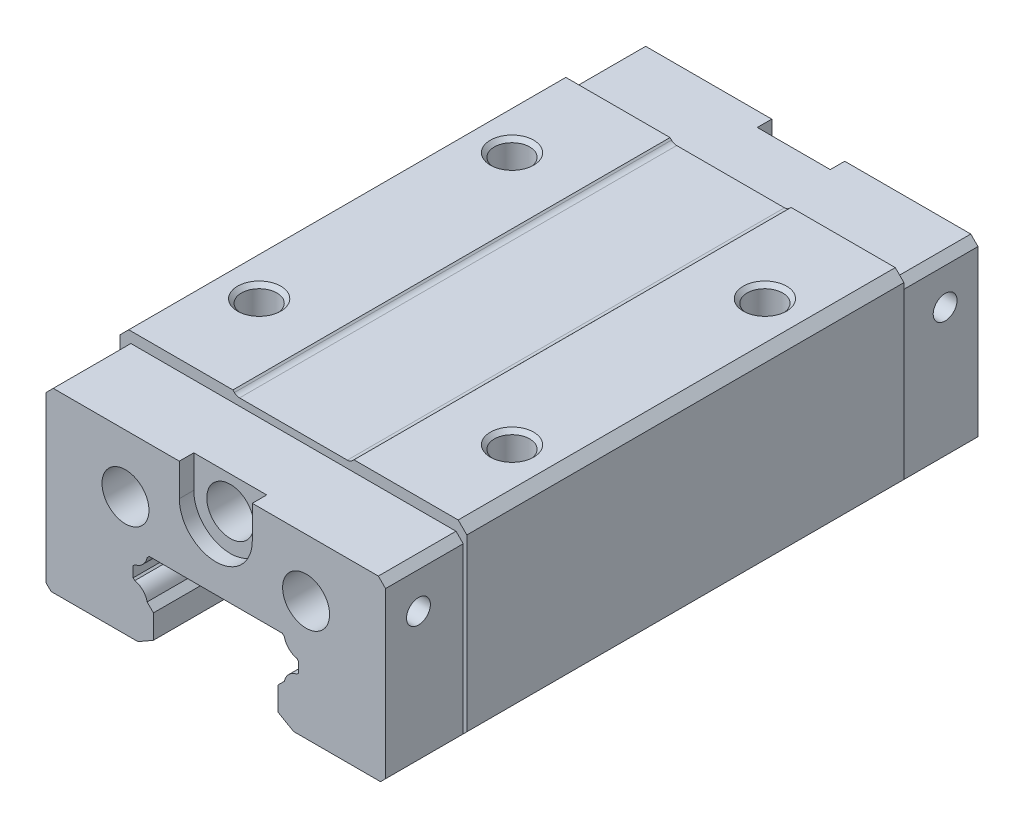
ISO-10303-21;
HEADER;
FILE_DESCRIPTION(('STEP AP214'),'2;1');
FILE_NAME('part.step','',(''),(''),'','','');
FILE_SCHEMA(('AUTOMOTIVE_DESIGN { 1 0 10303 214 1 1 1 1 }'));
ENDSEC;
DATA;
#1=APPLICATION_CONTEXT('core data for automotive mechanical design processes');
#2=APPLICATION_PROTOCOL_DEFINITION('international standard','automotive_design',2000,#1);
#3=PRODUCT_CONTEXT('',#1,'mechanical');
#4=PRODUCT('Part','Part','',(#3));
#5=PRODUCT_RELATED_PRODUCT_CATEGORY('part','',(#4));
#6=PRODUCT_DEFINITION_FORMATION('','',#4);
#7=PRODUCT_DEFINITION_CONTEXT('part definition',#1,'design');
#8=PRODUCT_DEFINITION('design','',#6,#7);
#9=PRODUCT_DEFINITION_SHAPE('','',#8);
#10=(LENGTH_UNIT() NAMED_UNIT(*) SI_UNIT(.MILLI.,.METRE.));
#11=(NAMED_UNIT(*) PLANE_ANGLE_UNIT() SI_UNIT($,.RADIAN.));
#12=(NAMED_UNIT(*) SI_UNIT($,.STERADIAN.) SOLID_ANGLE_UNIT());
#13=UNCERTAINTY_MEASURE_WITH_UNIT(LENGTH_MEASURE(1.E-05),#10,'distance_accuracy_value','');
#14=(GEOMETRIC_REPRESENTATION_CONTEXT(3) GLOBAL_UNCERTAINTY_ASSIGNED_CONTEXT((#13)) GLOBAL_UNIT_ASSIGNED_CONTEXT((#10,
#11,#12)) REPRESENTATION_CONTEXT('',''));
#15=CARTESIAN_POINT('',(0.,0.,0.));
#16=DIRECTION('',(0.,0.,1.));
#17=DIRECTION('',(1.,0.,0.));
#18=AXIS2_PLACEMENT_3D('',#15,#16,#17);
#19=CARTESIAN_POINT('',(-23.5033357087,-26.,-82.));
#20=DIRECTION('',(0.,0.,-1.));
#21=DIRECTION('',(0.,1.,0.));
#22=AXIS2_PLACEMENT_3D('',#19,#20,#21);
#23=PLANE('',#22);
#24=DIRECTION('',(0.,-1.,0.));
#25=VECTOR('',#24,1.);
#26=CARTESIAN_POINT('',(-5.05,-1.5,-82.));
#27=LINE('',#26,#25);
#28=CARTESIAN_POINT('',(-5.05,-1.5,-82.));
#29=VERTEX_POINT('',#28);
#30=CARTESIAN_POINT('',(-5.05,-5.9966792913,-82.));
#31=VERTEX_POINT('',#30);
#32=EDGE_CURVE('E387',#29,#31,#27,.T.);
#33=ORIENTED_EDGE('',*,*,#32,.T.);
#34=CARTESIAN_POINT('',(0.,-5.9966792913,-82.));
#35=DIRECTION('',(0.,0.,1.));
#36=DIRECTION('',(-1.,0.,0.));
#37=AXIS2_PLACEMENT_3D('',#34,#35,#36);
#38=CIRCLE('',#37,5.05);
#39=CARTESIAN_POINT('',(5.05,-5.9966792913,-82.));
#40=VERTEX_POINT('',#39);
#41=EDGE_CURVE('E375',#31,#40,#38,.T.);
#42=ORIENTED_EDGE('',*,*,#41,.T.);
#43=DIRECTION('',(0.,1.,0.));
#44=VECTOR('',#43,1.);
#45=CARTESIAN_POINT('',(5.05,-5.9966792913,-82.));
#46=LINE('',#45,#44);
#47=CARTESIAN_POINT('',(5.05,-1.5,-82.));
#48=VERTEX_POINT('',#47);
#49=EDGE_CURVE('E386',#40,#48,#46,.T.);
#50=ORIENTED_EDGE('',*,*,#49,.T.);
#51=DIRECTION('',(1.,0.,0.));
#52=VECTOR('',#51,1.);
#53=CARTESIAN_POINT('',(5.05,-1.5,-82.));
#54=LINE('',#53,#52);
#55=CARTESIAN_POINT('',(22.4966642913,-1.5,-82.));
#56=VERTEX_POINT('',#55);
#57=EDGE_CURVE('E408',#56,#48,#54,.F.);
#58=ORIENTED_EDGE('',*,*,#57,.F.);
#59=DIRECTION('',(0.707106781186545,-0.70710678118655,0.));
#60=VECTOR('',#59,1.);
#61=CARTESIAN_POINT('',(22.4966642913,-1.5,-82.));
#62=LINE('',#61,#60);
#63=CARTESIAN_POINT('',(23.4966642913,-2.5,-82.));
#64=VERTEX_POINT('',#63);
#65=EDGE_CURVE('E413',#64,#56,#62,.F.);
#66=ORIENTED_EDGE('',*,*,#65,.F.);
#67=DIRECTION('',(0.,-1.,0.));
#68=VECTOR('',#67,1.);
#69=CARTESIAN_POINT('',(23.4966642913,-2.5,-82.));
#70=LINE('',#69,#68);
#71=CARTESIAN_POINT('',(23.4966642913,-25.3,-82.));
#72=VERTEX_POINT('',#71);
#73=EDGE_CURVE('E417',#72,#64,#70,.F.);
#74=ORIENTED_EDGE('',*,*,#73,.F.);
#75=DIRECTION('',(-0.707106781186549,-0.707106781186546,0.));
#76=VECTOR('',#75,1.);
#77=CARTESIAN_POINT('',(23.4966642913,-25.3,-82.));
#78=LINE('',#77,#76);
#79=CARTESIAN_POINT('',(22.7966642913,-26.,-82.));
#80=VERTEX_POINT('',#79);
#81=EDGE_CURVE('E421',#80,#72,#78,.F.);
#82=ORIENTED_EDGE('',*,*,#81,.F.);
#83=DIRECTION('',(-1.,0.,0.));
#84=VECTOR('',#83,1.);
#85=CARTESIAN_POINT('',(22.7966642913,-26.,-82.));
#86=LINE('',#85,#84);
#87=CARTESIAN_POINT('',(10.7646134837,-26.,-82.));
#88=VERTEX_POINT('',#87);
#89=EDGE_CURVE('E426',#88,#80,#86,.F.);
#90=ORIENTED_EDGE('',*,*,#89,.F.);
#91=DIRECTION('',(-0.866025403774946,0.500000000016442,0.));
#92=VECTOR('',#91,1.);
#93=CARTESIAN_POINT('',(10.7646134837,-26.,-82.));
#94=LINE('',#93,#92);
#95=CARTESIAN_POINT('',(8.6266642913,-24.7656544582,-82.));
#96=VERTEX_POINT('',#95);
#97=EDGE_CURVE('E430',#96,#88,#94,.F.);
#98=ORIENTED_EDGE('',*,*,#97,.F.);
#99=DIRECTION('',(0.,1.,0.));
#100=VECTOR('',#99,1.);
#101=CARTESIAN_POINT('',(8.6266642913,-24.7656544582,-82.));
#102=LINE('',#101,#100);
#103=CARTESIAN_POINT('',(8.6266642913,-21.478974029,-82.));
#104=VERTEX_POINT('',#103);
#105=EDGE_CURVE('E435',#104,#96,#102,.F.);
#106=ORIENTED_EDGE('',*,*,#105,.F.);
#107=DIRECTION('',(0.707106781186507,0.707106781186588,0.));
#108=VECTOR('',#107,1.);
#109=CARTESIAN_POINT('',(8.6266642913,-21.478974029,-82.));
#110=LINE('',#109,#108);
#111=CARTESIAN_POINT('',(9.4993859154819,-20.606252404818,-82.));
#112=VERTEX_POINT('',#111);
#113=EDGE_CURVE('E440',#112,#104,#110,.F.);
#114=ORIENTED_EDGE('',*,*,#113,.F.);
#115=CARTESIAN_POINT('',(11.6528792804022,-21.0562149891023,-82.));
#116=DIRECTION('',(0.,0.,-1.));
#117=DIRECTION('',(-0.978860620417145,0.204528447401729,0.));
#118=AXIS2_PLACEMENT_3D('',#115,#116,#117);
#119=CIRCLE('',#118,2.20000000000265);
#120=CARTESIAN_POINT('',(11.202916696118,-18.902721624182,-82.));
#121=VERTEX_POINT('',#120);
#122=EDGE_CURVE('E445',#121,#112,#119,.F.);
#123=ORIENTED_EDGE('',*,*,#122,.F.);
#124=DIRECTION('',(0.707106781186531,0.707106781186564,0.));
#125=VECTOR('',#124,1.);
#126=CARTESIAN_POINT('',(11.202916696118,-18.902721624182,-82.));
#127=LINE('',#126,#125);
#128=CARTESIAN_POINT('',(11.4266642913,-18.678974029,-82.));
#129=VERTEX_POINT('',#128);
#130=EDGE_CURVE('E450',#129,#121,#127,.F.);
#131=ORIENTED_EDGE('',*,*,#130,.F.);
#132=DIRECTION('',(0.,1.,0.));
#133=VECTOR('',#132,1.);
#134=CARTESIAN_POINT('',(11.4266642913,-18.678974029,-82.));
#135=LINE('',#134,#133);
#136=CARTESIAN_POINT('',(11.4266642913,-17.221025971,-82.));
#137=VERTEX_POINT('',#136);
#138=EDGE_CURVE('E455',#137,#129,#135,.F.);
#139=ORIENTED_EDGE('',*,*,#138,.F.);
#140=DIRECTION('',(-0.707106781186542,0.707106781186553,0.));
#141=VECTOR('',#140,1.);
#142=CARTESIAN_POINT('',(11.4266642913,-17.221025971,-82.));
#143=LINE('',#142,#141);
#144=CARTESIAN_POINT('',(11.202916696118,-16.997278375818,-82.));
#145=VERTEX_POINT('',#144);
#146=EDGE_CURVE('E460',#145,#137,#143,.F.);
#147=ORIENTED_EDGE('',*,*,#146,.F.);
#148=CARTESIAN_POINT('',(11.6528792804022,-14.8437850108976,-82.));
#149=DIRECTION('',(0.,0.,-1.));
#150=DIRECTION('',(-0.20452844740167,-0.978860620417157,0.));
#151=AXIS2_PLACEMENT_3D('',#148,#149,#150);
#152=CIRCLE('',#151,2.20000000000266);
#153=CARTESIAN_POINT('',(9.4993859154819,-15.293747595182,-82.));
#154=VERTEX_POINT('',#153);
#155=EDGE_CURVE('E465',#154,#145,#152,.F.);
#156=ORIENTED_EDGE('',*,*,#155,.F.);
#157=DIRECTION('',(-0.707106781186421,0.707106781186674,0.));
#158=VECTOR('',#157,1.);
#159=CARTESIAN_POINT('',(9.4993859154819,-15.293747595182,-82.));
#160=LINE('',#159,#158);
#161=CARTESIAN_POINT('',(9.2056383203,-15.,-82.));
#162=VERTEX_POINT('',#161);
#163=EDGE_CURVE('E470',#162,#154,#160,.F.);
#164=ORIENTED_EDGE('',*,*,#163,.F.);
#165=DIRECTION('',(-1.,0.,0.));
#166=VECTOR('',#165,1.);
#167=CARTESIAN_POINT('',(9.2056383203,-15.,-82.));
#168=LINE('',#167,#166);
#169=CARTESIAN_POINT('',(-9.2123097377,-15.,-82.));
#170=VERTEX_POINT('',#169);
#171=EDGE_CURVE('E475',#170,#162,#168,.F.);
#172=ORIENTED_EDGE('',*,*,#171,.F.);
#173=DIRECTION('',(-0.707106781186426,-0.707106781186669,0.));
#174=VECTOR('',#173,1.);
#175=CARTESIAN_POINT('',(-9.2123097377,-15.,-82.));
#176=LINE('',#175,#174);
#177=CARTESIAN_POINT('',(-9.5060573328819,-15.293747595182,-82.));
#178=VERTEX_POINT('',#177);
#179=EDGE_CURVE('E480',#178,#170,#176,.F.);
#180=ORIENTED_EDGE('',*,*,#179,.F.);
#181=CARTESIAN_POINT('',(-11.6595506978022,-14.8437850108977,-82.));
#182=DIRECTION('',(0.,0.,-1.));
#183=DIRECTION('',(0.978860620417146,-0.204528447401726,0.));
#184=AXIS2_PLACEMENT_3D('',#181,#182,#183);
#185=CIRCLE('',#184,2.20000000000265);
#186=CARTESIAN_POINT('',(-11.209588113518,-16.997278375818,-82.));
#187=VERTEX_POINT('',#186);
#188=EDGE_CURVE('E485',#187,#178,#185,.F.);
#189=ORIENTED_EDGE('',*,*,#188,.F.);
#190=DIRECTION('',(-0.707106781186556,-0.707106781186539,0.));
#191=VECTOR('',#190,1.);
#192=CARTESIAN_POINT('',(-11.209588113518,-16.997278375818,-82.));
#193=LINE('',#192,#191);
#194=CARTESIAN_POINT('',(-11.4333357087,-17.221025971,-82.));
#195=VERTEX_POINT('',#194);
#196=EDGE_CURVE('E490',#195,#187,#193,.F.);
#197=ORIENTED_EDGE('',*,*,#196,.F.);
#198=DIRECTION('',(0.,-1.,0.));
#199=VECTOR('',#198,1.);
#200=CARTESIAN_POINT('',(-11.4333357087,-17.221025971,-82.));
#201=LINE('',#200,#199);
#202=CARTESIAN_POINT('',(-11.4333357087,-18.678974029,-82.));
#203=VERTEX_POINT('',#202);
#204=EDGE_CURVE('E495',#203,#195,#201,.F.);
#205=ORIENTED_EDGE('',*,*,#204,.F.);
#206=DIRECTION('',(0.707106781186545,-0.70710678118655,0.));
#207=VECTOR('',#206,1.);
#208=CARTESIAN_POINT('',(-11.4333357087,-18.678974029,-82.));
#209=LINE('',#208,#207);
#210=CARTESIAN_POINT('',(-11.209588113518,-18.902721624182,-82.));
#211=VERTEX_POINT('',#210);
#212=EDGE_CURVE('E500',#211,#203,#209,.F.);
#213=ORIENTED_EDGE('',*,*,#212,.F.);
#214=CARTESIAN_POINT('',(-11.6595506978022,-21.0562149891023,-82.));
#215=DIRECTION('',(0.,0.,-1.));
#216=DIRECTION('',(0.204528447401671,0.978860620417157,0.));
#217=AXIS2_PLACEMENT_3D('',#214,#215,#216);
#218=CIRCLE('',#217,2.20000000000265);
#219=CARTESIAN_POINT('',(-9.50605733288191,-20.606252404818,-82.));
#220=VERTEX_POINT('',#219);
#221=EDGE_CURVE('E505',#220,#211,#218,.F.);
#222=ORIENTED_EDGE('',*,*,#221,.F.);
#223=DIRECTION('',(0.707106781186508,-0.707106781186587,0.));
#224=VECTOR('',#223,1.);
#225=CARTESIAN_POINT('',(-9.5060573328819,-20.606252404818,-82.));
#226=LINE('',#225,#224);
#227=CARTESIAN_POINT('',(-8.6333357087,-21.478974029,-82.));
#228=VERTEX_POINT('',#227);
#229=EDGE_CURVE('E510',#228,#220,#226,.F.);
#230=ORIENTED_EDGE('',*,*,#229,.F.);
#231=DIRECTION('',(0.,-1.,0.));
#232=VECTOR('',#231,1.);
#233=CARTESIAN_POINT('',(-8.6333357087,-21.478974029,-82.));
#234=LINE('',#233,#232);
#235=CARTESIAN_POINT('',(-8.6333357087,-24.7656544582,-82.));
#236=VERTEX_POINT('',#235);
#237=EDGE_CURVE('E515',#236,#228,#234,.F.);
#238=ORIENTED_EDGE('',*,*,#237,.F.);
#239=DIRECTION('',(-0.866025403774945,-0.500000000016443,0.));
#240=VECTOR('',#239,1.);
#241=CARTESIAN_POINT('',(-8.6333357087,-24.7656544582,-82.));
#242=LINE('',#241,#240);
#243=CARTESIAN_POINT('',(-10.7712849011,-26.,-82.));
#244=VERTEX_POINT('',#243);
#245=EDGE_CURVE('E520',#244,#236,#242,.F.);
#246=ORIENTED_EDGE('',*,*,#245,.F.);
#247=DIRECTION('',(-1.,0.,0.));
#248=VECTOR('',#247,1.);
#249=CARTESIAN_POINT('',(-10.7712849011,-26.,-82.));
#250=LINE('',#249,#248);
#251=CARTESIAN_POINT('',(-22.8033357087,-26.,-82.));
#252=VERTEX_POINT('',#251);
#253=EDGE_CURVE('E525',#252,#244,#250,.F.);
#254=ORIENTED_EDGE('',*,*,#253,.F.);
#255=DIRECTION('',(-0.707106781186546,0.707106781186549,0.));
#256=VECTOR('',#255,1.);
#257=CARTESIAN_POINT('',(-22.8033357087,-26.,-82.));
#258=LINE('',#257,#256);
#259=CARTESIAN_POINT('',(-23.5033357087,-25.3,-82.));
#260=VERTEX_POINT('',#259);
#261=EDGE_CURVE('E530',#260,#252,#258,.F.);
#262=ORIENTED_EDGE('',*,*,#261,.F.);
#263=DIRECTION('',(0.,1.,0.));
#264=VECTOR('',#263,1.);
#265=CARTESIAN_POINT('',(-23.5033357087,-25.3,-82.));
#266=LINE('',#265,#264);
#267=CARTESIAN_POINT('',(-23.5033357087,-2.5,-82.));
#268=VERTEX_POINT('',#267);
#269=EDGE_CURVE('E535',#268,#260,#266,.F.);
#270=ORIENTED_EDGE('',*,*,#269,.F.);
#271=DIRECTION('',(0.707106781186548,0.707106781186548,0.));
#272=VECTOR('',#271,1.);
#273=CARTESIAN_POINT('',(-23.5033357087,-2.5,-82.));
#274=LINE('',#273,#272);
#275=CARTESIAN_POINT('',(-22.5033357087,-1.5,-82.));
#276=VERTEX_POINT('',#275);
#277=EDGE_CURVE('E539',#276,#268,#274,.F.);
#278=ORIENTED_EDGE('',*,*,#277,.F.);
#279=DIRECTION('',(1.,0.,0.));
#280=VECTOR('',#279,1.);
#281=CARTESIAN_POINT('',(-22.5033357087,-1.5,-82.));
#282=LINE('',#281,#280);
#283=EDGE_CURVE('E400',#29,#276,#282,.F.);
#284=ORIENTED_EDGE('',*,*,#283,.F.);
#285=EDGE_LOOP('',(#33,#42,#50,#58,#66,#74,#82,#90,#98,#106,#114,#123,#131,#139,#147,#156,#164,
#172,#180,#189,#197,#205,#213,#222,#230,#238,#246,#254,#262,#270,#278,#284));
#286=FACE_BOUND('',#285,.T.);
#287=CARTESIAN_POINT('',(-12.5033357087,-9.5,-82.));
#288=DIRECTION('',(0.,0.,1.));
#289=DIRECTION('',(-0.99999999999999,-1.4205392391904E-07,0.));
#290=AXIS2_PLACEMENT_3D('',#287,#288,#289);
#291=CIRCLE('',#290,3.2499999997);
#292=CARTESIAN_POINT('',(-15.7533357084,-9.50000046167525,-82.));
#293=VERTEX_POINT('',#292);
#294=EDGE_CURVE('E547',#293,#293,#291,.T.);
#295=ORIENTED_EDGE('',*,*,#294,.T.);
#296=EDGE_LOOP('',(#295));
#297=FACE_BOUND('',#296,.T.);
#298=CARTESIAN_POINT('',(12.4966642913,-9.5,-82.));
#299=DIRECTION('',(0.,0.,1.));
#300=DIRECTION('',(-1.,0.,0.));
#301=AXIS2_PLACEMENT_3D('',#298,#299,#300);
#302=CIRCLE('',#301,3.25);
#303=CARTESIAN_POINT('',(9.2466642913,-9.5,-82.));
#304=VERTEX_POINT('',#303);
#305=EDGE_CURVE('E552',#304,#304,#302,.T.);
#306=ORIENTED_EDGE('',*,*,#305,.T.);
#307=EDGE_LOOP('',(#306));
#308=FACE_BOUND('',#307,.T.);
#309=ADVANCED_FACE('F17',(#286,#297,#308),#23,.T.);
#310=CARTESIAN_POINT('',(-22.5033357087,-1.5,-71.25));
#311=DIRECTION('',(0.,1.,0.));
#312=DIRECTION('',(1.,0.,0.));
#313=AXIS2_PLACEMENT_3D('',#310,#311,#312);
#314=PLANE('',#313);
#315=DIRECTION('',(0.,0.,-1.));
#316=VECTOR('',#315,1.);
#317=CARTESIAN_POINT('',(-5.05,-1.5,-80.));
#318=LINE('',#317,#316);
#319=CARTESIAN_POINT('',(-5.05,-1.5,-80.));
#320=VERTEX_POINT('',#319);
#321=EDGE_CURVE('E555',#29,#320,#318,.F.);
#322=ORIENTED_EDGE('',*,*,#321,.F.);
#323=ORIENTED_EDGE('',*,*,#283,.T.);
#324=DIRECTION('',(0.,0.,1.));
#325=VECTOR('',#324,1.);
#326=CARTESIAN_POINT('',(-22.5033357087,-1.5,-82.));
#327=LINE('',#326,#325);
#328=CARTESIAN_POINT('',(-22.5033357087,-1.5,-71.25));
#329=VERTEX_POINT('',#328);
#330=EDGE_CURVE('E557',#329,#276,#327,.F.);
#331=ORIENTED_EDGE('',*,*,#330,.F.);
#332=DIRECTION('',(1.,0.,0.));
#333=VECTOR('',#332,1.);
#334=CARTESIAN_POINT('',(-22.5033357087,-1.5,-71.25));
#335=LINE('',#334,#333);
#336=CARTESIAN_POINT('',(22.4966642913,-1.5,-71.25));
#337=VERTEX_POINT('',#336);
#338=EDGE_CURVE('E561',#337,#329,#335,.F.);
#339=ORIENTED_EDGE('',*,*,#338,.F.);
#340=DIRECTION('',(0.,0.,-1.));
#341=VECTOR('',#340,1.);
#342=CARTESIAN_POINT('',(22.4966642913,-1.5,-71.25));
#343=LINE('',#342,#341);
#344=EDGE_CURVE('E565',#337,#56,#343,.T.);
#345=ORIENTED_EDGE('',*,*,#344,.T.);
#346=ORIENTED_EDGE('',*,*,#57,.T.);
#347=DIRECTION('',(0.,0.,1.));
#348=VECTOR('',#347,1.);
#349=CARTESIAN_POINT('',(5.05,-1.5,-82.));
#350=LINE('',#349,#348);
#351=CARTESIAN_POINT('',(5.05,-1.5,-80.));
#352=VERTEX_POINT('',#351);
#353=EDGE_CURVE('E570',#352,#48,#350,.F.);
#354=ORIENTED_EDGE('',*,*,#353,.F.);
#355=DIRECTION('',(-1.,0.,0.));
#356=VECTOR('',#355,1.);
#357=CARTESIAN_POINT('',(5.05,-1.5,-80.));
#358=LINE('',#357,#356);
#359=EDGE_CURVE('E574',#352,#320,#358,.T.);
#360=ORIENTED_EDGE('',*,*,#359,.T.);
#361=EDGE_LOOP('',(#322,#323,#331,#339,#345,#346,#354,#360));
#362=FACE_BOUND('',#361,.T.);
#363=ADVANCED_FACE('F1291',(#362),#314,.T.);
#364=CARTESIAN_POINT('',(-24.0033357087,-8.,-71.25));
#365=DIRECTION('',(-1.,0.,0.));
#366=DIRECTION('',(0.,0.,1.));
#367=AXIS2_PLACEMENT_3D('',#364,#365,#366);
#368=PLANE('',#367);
#369=DIRECTION('',(0.,-1.,0.));
#370=VECTOR('',#369,1.);
#371=CARTESIAN_POINT('',(-24.0033357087,-1.2,-71.25));
#372=LINE('',#371,#370);
#373=CARTESIAN_POINT('',(-24.0033357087,-8.,-71.25));
#374=VERTEX_POINT('',#373);
#375=CARTESIAN_POINT('',(-24.0033357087,-1.2,-71.25));
#376=VERTEX_POINT('',#375);
#377=EDGE_CURVE('E579',#374,#376,#372,.F.);
#378=ORIENTED_EDGE('',*,*,#377,.F.);
#379=DIRECTION('',(0.,0.,1.));
#380=VECTOR('',#379,1.);
#381=CARTESIAN_POINT('',(-24.0033357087,-8.,-71.25));
#382=LINE('',#381,#380);
#383=CARTESIAN_POINT('',(-24.0033357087,-8.,-10.75));
#384=VERTEX_POINT('',#383);
#385=EDGE_CURVE('E583',#374,#384,#382,.T.);
#386=ORIENTED_EDGE('',*,*,#385,.T.);
#387=DIRECTION('',(0.,1.,0.));
#388=VECTOR('',#387,1.);
#389=CARTESIAN_POINT('',(-24.0033357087,-8.,-10.75));
#390=LINE('',#389,#388);
#391=CARTESIAN_POINT('',(-24.0033357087,-1.2,-10.75));
#392=VERTEX_POINT('',#391);
#393=EDGE_CURVE('E588',#384,#392,#390,.T.);
#394=ORIENTED_EDGE('',*,*,#393,.T.);
#395=DIRECTION('',(0.,0.,-1.));
#396=VECTOR('',#395,1.);
#397=CARTESIAN_POINT('',(-24.0033357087,-1.2,-10.75));
#398=LINE('',#397,#396);
#399=EDGE_CURVE('E593',#376,#392,#398,.F.);
#400=ORIENTED_EDGE('',*,*,#399,.F.);
#401=EDGE_LOOP('',(#378,#386,#394,#400));
#402=FACE_BOUND('',#401,.T.);
#403=ADVANCED_FACE('F1296',(#402),#368,.T.);
#404=CARTESIAN_POINT('',(-24.0033357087,-8.,-71.25));
#405=DIRECTION('',(-0.707106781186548,-0.707106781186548,0.));
#406=DIRECTION('',(0.707106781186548,-0.707106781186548,0.));
#407=AXIS2_PLACEMENT_3D('',#404,#405,#406);
#408=PLANE('',#407);
#409=DIRECTION('',(0.707106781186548,-0.707106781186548,0.));
#410=VECTOR('',#409,1.);
#411=CARTESIAN_POINT('',(-24.0033357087,-8.,-71.25));
#412=LINE('',#411,#410);
#413=CARTESIAN_POINT('',(-23.6033357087,-8.4,-71.25));
#414=VERTEX_POINT('',#413);
#415=EDGE_CURVE('E598',#414,#374,#412,.F.);
#416=ORIENTED_EDGE('',*,*,#415,.F.);
#417=DIRECTION('',(0.,0.,1.));
#418=VECTOR('',#417,1.);
#419=CARTESIAN_POINT('',(-23.6033357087,-8.4,-71.25));
#420=LINE('',#419,#418);
#421=CARTESIAN_POINT('',(-23.6033357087,-8.4,-10.75));
#422=VERTEX_POINT('',#421);
#423=EDGE_CURVE('E602',#414,#422,#420,.T.);
#424=ORIENTED_EDGE('',*,*,#423,.T.);
#425=DIRECTION('',(-0.707106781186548,0.707106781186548,0.));
#426=VECTOR('',#425,1.);
#427=CARTESIAN_POINT('',(-23.6033357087,-8.4,-10.75));
#428=LINE('',#427,#426);
#429=EDGE_CURVE('E607',#422,#384,#428,.T.);
#430=ORIENTED_EDGE('',*,*,#429,.T.);
#431=ORIENTED_EDGE('',*,*,#385,.F.);
#432=EDGE_LOOP('',(#416,#424,#430,#431));
#433=FACE_BOUND('',#432,.T.);
#434=ADVANCED_FACE('F1302',(#433),#408,.T.);
#435=CARTESIAN_POINT('',(-23.6033357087,-25.2,-71.25));
#436=DIRECTION('',(-1.,0.,0.));
#437=DIRECTION('',(0.,0.,1.));
#438=AXIS2_PLACEMENT_3D('',#435,#436,#437);
#439=PLANE('',#438);
#440=DIRECTION('',(0.,-1.,0.));
#441=VECTOR('',#440,1.);
#442=CARTESIAN_POINT('',(-23.6033357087,-8.4,-71.25));
#443=LINE('',#442,#441);
#444=CARTESIAN_POINT('',(-23.6033357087,-25.2,-71.25));
#445=VERTEX_POINT('',#444);
#446=EDGE_CURVE('E612',#445,#414,#443,.F.);
#447=ORIENTED_EDGE('',*,*,#446,.F.);
#448=DIRECTION('',(0.,0.,1.));
#449=VECTOR('',#448,1.);
#450=CARTESIAN_POINT('',(-23.6033357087,-25.2,-71.25));
#451=LINE('',#450,#449);
#452=CARTESIAN_POINT('',(-23.6033357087,-25.2,-10.75));
#453=VERTEX_POINT('',#452);
#454=EDGE_CURVE('E616',#445,#453,#451,.T.);
#455=ORIENTED_EDGE('',*,*,#454,.T.);
#456=DIRECTION('',(0.,1.,0.));
#457=VECTOR('',#456,1.);
#458=CARTESIAN_POINT('',(-23.6033357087,-25.2,-10.75));
#459=LINE('',#458,#457);
#460=EDGE_CURVE('E621',#453,#422,#459,.T.);
#461=ORIENTED_EDGE('',*,*,#460,.T.);
#462=ORIENTED_EDGE('',*,*,#423,.F.);
#463=EDGE_LOOP('',(#447,#455,#461,#462));
#464=FACE_BOUND('',#463,.T.);
#465=ADVANCED_FACE('F1306',(#464),#439,.T.);
#466=CARTESIAN_POINT('',(-23.6033357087,-25.2,-82.));
#467=DIRECTION('',(-0.707106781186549,-0.707106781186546,0.));
#468=DIRECTION('',(0.707106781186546,-0.707106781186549,0.));
#469=AXIS2_PLACEMENT_3D('',#466,#467,#468);
#470=PLANE('',#469);
#471=DIRECTION('',(0.707106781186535,-0.70710678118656,0.));
#472=VECTOR('',#471,1.);
#473=CARTESIAN_POINT('',(-23.6033357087,-25.2,-71.25));
#474=LINE('',#473,#472);
#475=CARTESIAN_POINT('',(-23.5033357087,-25.3,-71.25));
#476=VERTEX_POINT('',#475);
#477=EDGE_CURVE('E626',#476,#445,#474,.F.);
#478=ORIENTED_EDGE('',*,*,#477,.F.);
#479=DIRECTION('',(0.,0.,-1.));
#480=VECTOR('',#479,1.);
#481=CARTESIAN_POINT('',(-23.5033357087,-25.3,-71.25));
#482=LINE('',#481,#480);
#483=EDGE_CURVE('E630',#476,#260,#482,.T.);
#484=ORIENTED_EDGE('',*,*,#483,.T.);
#485=ORIENTED_EDGE('',*,*,#261,.T.);
#486=DIRECTION('',(0.,0.,1.));
#487=VECTOR('',#486,1.);
#488=CARTESIAN_POINT('',(-22.8033357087,-26.,-82.));
#489=LINE('',#488,#487);
#490=CARTESIAN_POINT('',(-22.8033357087,-26.,0.));
#491=VERTEX_POINT('',#490);
#492=EDGE_CURVE('E635',#252,#491,#489,.T.);
#493=ORIENTED_EDGE('',*,*,#492,.T.);
#494=DIRECTION('',(-0.707106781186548,0.707106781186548,0.));
#495=VECTOR('',#494,1.);
#496=CARTESIAN_POINT('',(-22.8033357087,-26.,0.));
#497=LINE('',#496,#495);
#498=CARTESIAN_POINT('',(-23.5033357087,-25.3,0.));
#499=VERTEX_POINT('',#498);
#500=EDGE_CURVE('E640',#499,#491,#497,.F.);
#501=ORIENTED_EDGE('',*,*,#500,.F.);
#502=DIRECTION('',(0.,0.,-1.));
#503=VECTOR('',#502,1.);
#504=CARTESIAN_POINT('',(-23.5033357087,-25.3,0.));
#505=LINE('',#504,#503);
#506=CARTESIAN_POINT('',(-23.5033357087,-25.3,-10.75));
#507=VERTEX_POINT('',#506);
#508=EDGE_CURVE('E645',#507,#499,#505,.F.);
#509=ORIENTED_EDGE('',*,*,#508,.F.);
#510=DIRECTION('',(-0.707106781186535,0.70710678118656,1.00485917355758E-13));
#511=VECTOR('',#510,1.);
#512=CARTESIAN_POINT('',(-23.5033357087,-25.3,-10.75));
#513=LINE('',#512,#511);
#514=EDGE_CURVE('E649',#507,#453,#513,.T.);
#515=ORIENTED_EDGE('',*,*,#514,.T.);
#516=ORIENTED_EDGE('',*,*,#454,.F.);
#517=EDGE_LOOP('',(#478,#484,#485,#493,#501,#509,#515,#516));
#518=FACE_BOUND('',#517,.T.);
#519=ADVANCED_FACE('F1310',(#518),#470,.T.);
#520=CARTESIAN_POINT('',(22.7966642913,-26.,-82.));
#521=DIRECTION('',(0.707106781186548,-0.707106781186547,0.));
#522=DIRECTION('',(0.707106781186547,0.707106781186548,0.));
#523=AXIS2_PLACEMENT_3D('',#520,#521,#522);
#524=PLANE('',#523);
#525=DIRECTION('',(0.707106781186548,0.707106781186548,0.));
#526=VECTOR('',#525,1.);
#527=CARTESIAN_POINT('',(23.4966642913,-25.3,-71.25));
#528=LINE('',#527,#526);
#529=CARTESIAN_POINT('',(23.9966642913,-24.8,-71.25));
#530=VERTEX_POINT('',#529);
#531=CARTESIAN_POINT('',(23.4966642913,-25.3,-71.25));
#532=VERTEX_POINT('',#531);
#533=EDGE_CURVE('E654',#530,#532,#528,.F.);
#534=ORIENTED_EDGE('',*,*,#533,.F.);
#535=DIRECTION('',(0.,0.,1.));
#536=VECTOR('',#535,1.);
#537=CARTESIAN_POINT('',(23.9966642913,-24.8,-71.25));
#538=LINE('',#537,#536);
#539=CARTESIAN_POINT('',(23.9966642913,-24.8,-10.75));
#540=VERTEX_POINT('',#539);
#541=EDGE_CURVE('E658',#530,#540,#538,.T.);
#542=ORIENTED_EDGE('',*,*,#541,.T.);
#543=DIRECTION('',(-0.70710678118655,-0.707106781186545,0.));
#544=VECTOR('',#543,1.);
#545=CARTESIAN_POINT('',(23.9966642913,-24.8,-10.75));
#546=LINE('',#545,#544);
#547=CARTESIAN_POINT('',(23.4966642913,-25.3,-10.75));
#548=VERTEX_POINT('',#547);
#549=EDGE_CURVE('E663',#540,#548,#546,.T.);
#550=ORIENTED_EDGE('',*,*,#549,.T.);
#551=DIRECTION('',(0.,0.,1.));
#552=VECTOR('',#551,1.);
#553=CARTESIAN_POINT('',(23.4966642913,-25.3,-10.75));
#554=LINE('',#553,#552);
#555=CARTESIAN_POINT('',(23.4966642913,-25.3,0.));
#556=VERTEX_POINT('',#555);
#557=EDGE_CURVE('E668',#548,#556,#554,.T.);
#558=ORIENTED_EDGE('',*,*,#557,.T.);
#559=DIRECTION('',(-0.707106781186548,-0.707106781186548,0.));
#560=VECTOR('',#559,1.);
#561=CARTESIAN_POINT('',(23.4966642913,-25.3,0.));
#562=LINE('',#561,#560);
#563=CARTESIAN_POINT('',(22.7966642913,-26.,0.));
#564=VERTEX_POINT('',#563);
#565=EDGE_CURVE('E673',#564,#556,#562,.F.);
#566=ORIENTED_EDGE('',*,*,#565,.F.);
#567=DIRECTION('',(0.,0.,-1.));
#568=VECTOR('',#567,1.);
#569=CARTESIAN_POINT('',(22.7966642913,-26.,0.));
#570=LINE('',#569,#568);
#571=EDGE_CURVE('E678',#80,#564,#570,.F.);
#572=ORIENTED_EDGE('',*,*,#571,.F.);
#573=ORIENTED_EDGE('',*,*,#81,.T.);
#574=DIRECTION('',(0.,0.,1.));
#575=VECTOR('',#574,1.);
#576=CARTESIAN_POINT('',(23.4966642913,-25.3,-82.));
#577=LINE('',#576,#575);
#578=EDGE_CURVE('E682',#532,#72,#577,.F.);
#579=ORIENTED_EDGE('',*,*,#578,.F.);
#580=EDGE_LOOP('',(#534,#542,#550,#558,#566,#572,#573,#579));
#581=FACE_BOUND('',#580,.T.);
#582=ADVANCED_FACE('F1314',(#581),#524,.T.);
#583=CARTESIAN_POINT('',(23.9966642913,-24.8,-10.75));
#584=DIRECTION('',(1.,0.,0.));
#585=DIRECTION('',(0.,0.,-1.));
#586=AXIS2_PLACEMENT_3D('',#583,#584,#585);
#587=PLANE('',#586);
#588=DIRECTION('',(0.,1.,0.));
#589=VECTOR('',#588,1.);
#590=CARTESIAN_POINT('',(23.9966642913,-24.8,-71.25));
#591=LINE('',#590,#589);
#592=CARTESIAN_POINT('',(23.9966642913,-1.2,-71.25));
#593=VERTEX_POINT('',#592);
#594=EDGE_CURVE('E686',#593,#530,#591,.F.);
#595=ORIENTED_EDGE('',*,*,#594,.F.);
#596=DIRECTION('',(0.,0.,1.));
#597=VECTOR('',#596,1.);
#598=CARTESIAN_POINT('',(23.9966642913,-1.2,-71.25));
#599=LINE('',#598,#597);
#600=CARTESIAN_POINT('',(23.9966642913,-1.2,-10.75));
#601=VERTEX_POINT('',#600);
#602=EDGE_CURVE('E690',#593,#601,#599,.T.);
#603=ORIENTED_EDGE('',*,*,#602,.T.);
#604=DIRECTION('',(0.,-1.,0.));
#605=VECTOR('',#604,1.);
#606=CARTESIAN_POINT('',(23.9966642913,-1.2,-10.75));
#607=LINE('',#606,#605);
#608=EDGE_CURVE('E695',#601,#540,#607,.T.);
#609=ORIENTED_EDGE('',*,*,#608,.T.);
#610=ORIENTED_EDGE('',*,*,#541,.F.);
#611=EDGE_LOOP('',(#595,#603,#609,#610));
#612=FACE_BOUND('',#611,.T.);
#613=ADVANCED_FACE('F1318',(#612),#587,.T.);
#614=CARTESIAN_POINT('',(23.9966642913,-1.2,-71.25));
#615=DIRECTION('',(0.707106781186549,0.707106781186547,0.));
#616=DIRECTION('',(-0.707106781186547,0.707106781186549,0.));
#617=AXIS2_PLACEMENT_3D('',#614,#615,#616);
#618=PLANE('',#617);
#619=DIRECTION('',(-0.707106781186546,0.707106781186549,0.));
#620=VECTOR('',#619,1.);
#621=CARTESIAN_POINT('',(23.9966642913,-1.2,-71.25));
#622=LINE('',#621,#620);
#623=CARTESIAN_POINT('',(22.7966642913,0.,-71.25));
#624=VERTEX_POINT('',#623);
#625=EDGE_CURVE('E700',#624,#593,#622,.F.);
#626=ORIENTED_EDGE('',*,*,#625,.F.);
#627=DIRECTION('',(0.,0.,1.));
#628=VECTOR('',#627,1.);
#629=CARTESIAN_POINT('',(22.7966642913,0.,-71.25));
#630=LINE('',#629,#628);
#631=CARTESIAN_POINT('',(22.7966642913,0.,-10.75));
#632=VERTEX_POINT('',#631);
#633=EDGE_CURVE('E704',#624,#632,#630,.T.);
#634=ORIENTED_EDGE('',*,*,#633,.T.);
#635=DIRECTION('',(0.707106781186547,-0.707106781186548,0.));
#636=VECTOR('',#635,1.);
#637=CARTESIAN_POINT('',(22.7966642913,0.,-10.75));
#638=LINE('',#637,#636);
#639=EDGE_CURVE('E709',#632,#601,#638,.T.);
#640=ORIENTED_EDGE('',*,*,#639,.T.);
#641=ORIENTED_EDGE('',*,*,#602,.F.);
#642=EDGE_LOOP('',(#626,#634,#640,#641));
#643=FACE_BOUND('',#642,.T.);
#644=ADVANCED_FACE('F1322',(#643),#618,.T.);
#645=CARTESIAN_POINT('',(8.3724002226,0.,-71.25));
#646=DIRECTION('',(0.,1.,0.));
#647=DIRECTION('',(0.,0.,1.));
#648=AXIS2_PLACEMENT_3D('',#645,#646,#647);
#649=PLANE('',#648);
#650=DIRECTION('',(-1.,0.,0.));
#651=VECTOR('',#650,1.);
#652=CARTESIAN_POINT('',(22.7966642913,0.,-71.25));
#653=LINE('',#652,#651);
#654=CARTESIAN_POINT('',(8.3724002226,0.,-71.25));
#655=VERTEX_POINT('',#654);
#656=EDGE_CURVE('E714',#655,#624,#653,.F.);
#657=ORIENTED_EDGE('',*,*,#656,.F.);
#658=DIRECTION('',(0.,0.,1.));
#659=VECTOR('',#658,1.);
#660=CARTESIAN_POINT('',(8.3724002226,0.,-71.25));
#661=LINE('',#660,#659);
#662=CARTESIAN_POINT('',(8.3724002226,0.,-10.75));
#663=VERTEX_POINT('',#662);
#664=EDGE_CURVE('E718',#655,#663,#661,.T.);
#665=ORIENTED_EDGE('',*,*,#664,.T.);
#666=DIRECTION('',(1.,0.,0.));
#667=VECTOR('',#666,1.);
#668=CARTESIAN_POINT('',(8.3724002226,0.,-10.75));
#669=LINE('',#668,#667);
#670=EDGE_CURVE('E723',#663,#632,#669,.T.);
#671=ORIENTED_EDGE('',*,*,#670,.T.);
#672=ORIENTED_EDGE('',*,*,#633,.F.);
#673=EDGE_LOOP('',(#657,#665,#671,#672));
#674=FACE_BOUND('',#673,.T.);
#675=CARTESIAN_POINT('',(17.5,0.,-23.5));
#676=DIRECTION('',(0.,-1.,0.));
#677=DIRECTION('',(0.,0.,1.));
#678=AXIS2_PLACEMENT_3D('',#675,#676,#677);
#679=CIRCLE('',#678,3.);
#680=CARTESIAN_POINT('',(17.5,0.,-20.5));
#681=VERTEX_POINT('',#680);
#682=EDGE_CURVE('E728',#681,#681,#679,.T.);
#683=ORIENTED_EDGE('',*,*,#682,.T.);
#684=EDGE_LOOP('',(#683));
#685=FACE_BOUND('',#684,.T.);
#686=CARTESIAN_POINT('',(17.5,0.,-58.5));
#687=DIRECTION('',(0.,-1.,0.));
#688=DIRECTION('',(0.,0.,1.));
#689=AXIS2_PLACEMENT_3D('',#686,#687,#688);
#690=CIRCLE('',#689,3.);
#691=CARTESIAN_POINT('',(17.5,0.,-55.5));
#692=VERTEX_POINT('',#691);
#693=EDGE_CURVE('E733',#692,#692,#690,.T.);
#694=ORIENTED_EDGE('',*,*,#693,.T.);
#695=EDGE_LOOP('',(#694));
#696=FACE_BOUND('',#695,.T.);
#697=ADVANCED_FACE('F1326',(#674,#685,#696),#649,.T.);
#698=CARTESIAN_POINT('',(8.3724002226,0.,-71.25));
#699=DIRECTION('',(-0.707106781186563,0.707106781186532,0.));
#700=DIRECTION('',(-0.707106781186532,-0.707106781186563,0.));
#701=AXIS2_PLACEMENT_3D('',#698,#699,#700);
#702=PLANE('',#701);
#703=DIRECTION('',(-0.707106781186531,-0.707106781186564,0.));
#704=VECTOR('',#703,1.);
#705=CARTESIAN_POINT('',(8.3724002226,0.,-71.25));
#706=LINE('',#705,#704);
#707=CARTESIAN_POINT('',(8.1652934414,-0.207106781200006,-71.25));
#708=VERTEX_POINT('',#707);
#709=EDGE_CURVE('E736',#708,#655,#706,.F.);
#710=ORIENTED_EDGE('',*,*,#709,.F.);
#711=DIRECTION('',(0.,0.,1.));
#712=VECTOR('',#711,1.);
#713=CARTESIAN_POINT('',(8.1652934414,-0.207106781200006,-71.25));
#714=LINE('',#713,#712);
#715=CARTESIAN_POINT('',(8.1652934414,-0.207106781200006,-10.75));
#716=VERTEX_POINT('',#715);
#717=EDGE_CURVE('E738',#708,#716,#714,.T.);
#718=ORIENTED_EDGE('',*,*,#717,.T.);
#719=DIRECTION('',(0.707106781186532,0.707106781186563,0.));
#720=VECTOR('',#719,1.);
#721=CARTESIAN_POINT('',(8.1652934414,-0.207106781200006,-10.75));
#722=LINE('',#721,#720);
#723=EDGE_CURVE('E743',#716,#663,#722,.T.);
#724=ORIENTED_EDGE('',*,*,#723,.T.);
#725=ORIENTED_EDGE('',*,*,#664,.F.);
#726=EDGE_LOOP('',(#710,#718,#724,#725));
#727=FACE_BOUND('',#726,.T.);
#728=ADVANCED_FACE('F1330',(#727),#702,.T.);
#729=CARTESIAN_POINT('',(7.45818666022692,0.499999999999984,-82.));
#730=DIRECTION('',(0.,0.,1.));
#731=DIRECTION('',(-2.69217597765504E-11,-1.,0.));
#732=AXIS2_PLACEMENT_3D('',#729,#730,#731);
#733=CYLINDRICAL_SURFACE('',#732,0.999999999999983);
#734=ORIENTED_EDGE('',*,*,#717,.F.);
#735=CARTESIAN_POINT('',(7.45818666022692,0.499999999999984,-71.25));
#736=DIRECTION('',(0.,0.,-1.));
#737=DIRECTION('',(0.707106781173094,-0.707106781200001,0.));
#738=AXIS2_PLACEMENT_3D('',#735,#736,#737);
#739=CIRCLE('',#738,0.999999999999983);
#740=CARTESIAN_POINT('',(7.4581866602,-0.499999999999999,-71.25));
#741=VERTEX_POINT('',#740);
#742=EDGE_CURVE('E748',#708,#741,#739,.T.);
#743=ORIENTED_EDGE('',*,*,#742,.T.);
#744=DIRECTION('',(0.,0.,1.));
#745=VECTOR('',#744,1.);
#746=CARTESIAN_POINT('',(7.4581866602,-0.499999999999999,-71.25));
#747=LINE('',#746,#745);
#748=CARTESIAN_POINT('',(7.4581866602,-0.499999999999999,-10.75));
#749=VERTEX_POINT('',#748);
#750=EDGE_CURVE('E753',#741,#749,#747,.T.);
#751=ORIENTED_EDGE('',*,*,#750,.T.);
#752=CARTESIAN_POINT('',(7.45818666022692,0.499999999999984,-10.75));
#753=DIRECTION('',(0.,0.,1.));
#754=DIRECTION('',(-2.6921576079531E-11,-1.,0.));
#755=AXIS2_PLACEMENT_3D('',#752,#753,#754);
#756=CIRCLE('',#755,0.999999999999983);
#757=EDGE_CURVE('E758',#716,#749,#756,.F.);
#758=ORIENTED_EDGE('',*,*,#757,.F.);
#759=EDGE_LOOP('',(#734,#743,#751,#758));
#760=FACE_BOUND('',#759,.T.);
#761=ADVANCED_FACE('F1334',(#760),#733,.F.);
#762=CARTESIAN_POINT('',(-7.4648580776,-0.5,-71.25));
#763=DIRECTION('',(0.,1.,0.));
#764=DIRECTION('',(0.,0.,1.));
#765=AXIS2_PLACEMENT_3D('',#762,#763,#764);
#766=PLANE('',#765);
#767=DIRECTION('',(-1.,0.,0.));
#768=VECTOR('',#767,1.);
#769=CARTESIAN_POINT('',(7.4581866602,-0.5,-71.25));
#770=LINE('',#769,#768);
#771=CARTESIAN_POINT('',(-7.4648580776,-0.5,-71.25));
#772=VERTEX_POINT('',#771);
#773=EDGE_CURVE('E762',#772,#741,#770,.F.);
#774=ORIENTED_EDGE('',*,*,#773,.F.);
#775=DIRECTION('',(0.,0.,1.));
#776=VECTOR('',#775,1.);
#777=CARTESIAN_POINT('',(-7.4648580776,-0.5,-71.25));
#778=LINE('',#777,#776);
#779=CARTESIAN_POINT('',(-7.4648580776,-0.5,-10.75));
#780=VERTEX_POINT('',#779);
#781=EDGE_CURVE('E766',#772,#780,#778,.T.);
#782=ORIENTED_EDGE('',*,*,#781,.T.);
#783=DIRECTION('',(1.,0.,0.));
#784=VECTOR('',#783,1.);
#785=CARTESIAN_POINT('',(-7.4648580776,-0.5,-10.75));
#786=LINE('',#785,#784);
#787=EDGE_CURVE('E771',#780,#749,#786,.T.);
#788=ORIENTED_EDGE('',*,*,#787,.T.);
#789=ORIENTED_EDGE('',*,*,#750,.F.);
#790=EDGE_LOOP('',(#774,#782,#788,#789));
#791=FACE_BOUND('',#790,.T.);
#792=ADVANCED_FACE('F1338',(#791),#766,.T.);
#793=CARTESIAN_POINT('',(-7.46485807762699,0.499999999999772,-82.));
#794=DIRECTION('',(0.,0.,1.));
#795=DIRECTION('',(-0.707106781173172,-0.707106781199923,0.));
#796=AXIS2_PLACEMENT_3D('',#793,#794,#795);
#797=CYLINDRICAL_SURFACE('',#796,0.999999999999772);
#798=ORIENTED_EDGE('',*,*,#781,.F.);
#799=CARTESIAN_POINT('',(-7.46485807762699,0.499999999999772,-71.25));
#800=DIRECTION('',(0.,0.,-1.));
#801=DIRECTION('',(2.69908539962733E-11,-1.,0.));
#802=AXIS2_PLACEMENT_3D('',#799,#800,#801);
#803=CIRCLE('',#802,0.999999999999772);
#804=CARTESIAN_POINT('',(-8.1719648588,-0.20710678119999,-71.25));
#805=VERTEX_POINT('',#804);
#806=EDGE_CURVE('E776',#772,#805,#803,.T.);
#807=ORIENTED_EDGE('',*,*,#806,.T.);
#808=DIRECTION('',(0.,0.,1.));
#809=VECTOR('',#808,1.);
#810=CARTESIAN_POINT('',(-8.1719648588,-0.207106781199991,-71.25));
#811=LINE('',#810,#809);
#812=CARTESIAN_POINT('',(-8.1719648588,-0.20710678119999,-10.75));
#813=VERTEX_POINT('',#812);
#814=EDGE_CURVE('E781',#805,#813,#811,.T.);
#815=ORIENTED_EDGE('',*,*,#814,.T.);
#816=CARTESIAN_POINT('',(-7.46485807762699,0.499999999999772,-10.75));
#817=DIRECTION('',(0.,0.,1.));
#818=DIRECTION('',(-0.707106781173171,-0.707106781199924,0.));
#819=AXIS2_PLACEMENT_3D('',#816,#817,#818);
#820=CIRCLE('',#819,0.999999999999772);
#821=EDGE_CURVE('E786',#780,#813,#820,.F.);
#822=ORIENTED_EDGE('',*,*,#821,.F.);
#823=EDGE_LOOP('',(#798,#807,#815,#822));
#824=FACE_BOUND('',#823,.T.);
#825=ADVANCED_FACE('F1342',(#824),#797,.F.);
#826=CARTESIAN_POINT('',(-8.1719648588,-0.207106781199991,-71.25));
#827=DIRECTION('',(0.707106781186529,0.707106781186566,0.));
#828=DIRECTION('',(-0.707106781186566,0.707106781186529,0.));
#829=AXIS2_PLACEMENT_3D('',#826,#827,#828);
#830=PLANE('',#829);
#831=DIRECTION('',(-0.707106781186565,0.70710678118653,0.));
#832=VECTOR('',#831,1.);
#833=CARTESIAN_POINT('',(-8.1719648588,-0.20710678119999,-71.25));
#834=LINE('',#833,#832);
#835=CARTESIAN_POINT('',(-8.37907164,0.,-71.25));
#836=VERTEX_POINT('',#835);
#837=EDGE_CURVE('E790',#836,#805,#834,.F.);
#838=ORIENTED_EDGE('',*,*,#837,.F.);
#839=DIRECTION('',(0.,0.,1.));
#840=VECTOR('',#839,1.);
#841=CARTESIAN_POINT('',(-8.37907164,0.,-71.25));
#842=LINE('',#841,#840);
#843=CARTESIAN_POINT('',(-8.37907164,0.,-10.75));
#844=VERTEX_POINT('',#843);
#845=EDGE_CURVE('E794',#836,#844,#842,.T.);
#846=ORIENTED_EDGE('',*,*,#845,.T.);
#847=DIRECTION('',(0.707106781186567,-0.707106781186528,0.));
#848=VECTOR('',#847,1.);
#849=CARTESIAN_POINT('',(-8.37907164,0.,-10.75));
#850=LINE('',#849,#848);
#851=EDGE_CURVE('E799',#844,#813,#850,.T.);
#852=ORIENTED_EDGE('',*,*,#851,.T.);
#853=ORIENTED_EDGE('',*,*,#814,.F.);
#854=EDGE_LOOP('',(#838,#846,#852,#853));
#855=FACE_BOUND('',#854,.T.);
#856=ADVANCED_FACE('F1346',(#855),#830,.T.);
#857=CARTESIAN_POINT('',(-22.8033357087,0.,-71.25));
#858=DIRECTION('',(0.,1.,0.));
#859=DIRECTION('',(0.,0.,1.));
#860=AXIS2_PLACEMENT_3D('',#857,#858,#859);
#861=PLANE('',#860);
#862=DIRECTION('',(-1.,0.,0.));
#863=VECTOR('',#862,1.);
#864=CARTESIAN_POINT('',(-8.37907164,0.,-71.25));
#865=LINE('',#864,#863);
#866=CARTESIAN_POINT('',(-22.8033357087,0.,-71.25));
#867=VERTEX_POINT('',#866);
#868=EDGE_CURVE('E804',#867,#836,#865,.F.);
#869=ORIENTED_EDGE('',*,*,#868,.F.);
#870=DIRECTION('',(0.,0.,1.));
#871=VECTOR('',#870,1.);
#872=CARTESIAN_POINT('',(-22.8033357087,0.,-71.25));
#873=LINE('',#872,#871);
#874=CARTESIAN_POINT('',(-22.8033357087,0.,-10.75));
#875=VERTEX_POINT('',#874);
#876=EDGE_CURVE('E808',#867,#875,#873,.T.);
#877=ORIENTED_EDGE('',*,*,#876,.T.);
#878=DIRECTION('',(1.,0.,0.));
#879=VECTOR('',#878,1.);
#880=CARTESIAN_POINT('',(-22.8033357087,0.,-10.75));
#881=LINE('',#880,#879);
#882=EDGE_CURVE('E813',#875,#844,#881,.T.);
#883=ORIENTED_EDGE('',*,*,#882,.T.);
#884=ORIENTED_EDGE('',*,*,#845,.F.);
#885=EDGE_LOOP('',(#869,#877,#883,#884));
#886=FACE_BOUND('',#885,.T.);
#887=CARTESIAN_POINT('',(-17.5,0.,-58.5));
#888=DIRECTION('',(0.,-1.,0.));
#889=DIRECTION('',(0.,0.,1.));
#890=AXIS2_PLACEMENT_3D('',#887,#888,#889);
#891=CIRCLE('',#890,3.);
#892=CARTESIAN_POINT('',(-17.5,0.,-55.5));
#893=VERTEX_POINT('',#892);
#894=EDGE_CURVE('E818',#893,#893,#891,.T.);
#895=ORIENTED_EDGE('',*,*,#894,.T.);
#896=EDGE_LOOP('',(#895));
#897=FACE_BOUND('',#896,.T.);
#898=CARTESIAN_POINT('',(-17.5,0.,-23.5));
#899=DIRECTION('',(0.,-1.,0.));
#900=DIRECTION('',(0.,0.,1.));
#901=AXIS2_PLACEMENT_3D('',#898,#899,#900);
#902=CIRCLE('',#901,3.);
#903=CARTESIAN_POINT('',(-17.5,0.,-20.5));
#904=VERTEX_POINT('',#903);
#905=EDGE_CURVE('E823',#904,#904,#902,.T.);
#906=ORIENTED_EDGE('',*,*,#905,.T.);
#907=EDGE_LOOP('',(#906));
#908=FACE_BOUND('',#907,.T.);
#909=ADVANCED_FACE('F1350',(#886,#897,#908),#861,.T.);
#910=CARTESIAN_POINT('',(-22.8033357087,0.,-71.25));
#911=DIRECTION('',(-0.707106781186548,0.707106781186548,0.));
#912=DIRECTION('',(-0.707106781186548,-0.707106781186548,0.));
#913=AXIS2_PLACEMENT_3D('',#910,#911,#912);
#914=PLANE('',#913);
#915=DIRECTION('',(-0.707106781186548,-0.707106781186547,0.));
#916=VECTOR('',#915,1.);
#917=CARTESIAN_POINT('',(-22.8033357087,0.,-71.25));
#918=LINE('',#917,#916);
#919=EDGE_CURVE('E826',#376,#867,#918,.F.);
#920=ORIENTED_EDGE('',*,*,#919,.F.);
#921=ORIENTED_EDGE('',*,*,#399,.T.);
#922=DIRECTION('',(0.707106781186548,0.707106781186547,0.));
#923=VECTOR('',#922,1.);
#924=CARTESIAN_POINT('',(-24.0033357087,-1.2,-10.75));
#925=LINE('',#924,#923);
#926=EDGE_CURVE('E828',#392,#875,#925,.T.);
#927=ORIENTED_EDGE('',*,*,#926,.T.);
#928=ORIENTED_EDGE('',*,*,#876,.F.);
#929=EDGE_LOOP('',(#920,#921,#927,#928));
#930=FACE_BOUND('',#929,.T.);
#931=ADVANCED_FACE('F1354',(#930),#914,.T.);
#932=CARTESIAN_POINT('',(-23.5033357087,-26.,0.));
#933=DIRECTION('',(0.,0.,1.));
#934=DIRECTION('',(1.,0.,0.));
#935=AXIS2_PLACEMENT_3D('',#932,#933,#934);
#936=PLANE('',#935);
#937=DIRECTION('',(0.,1.,0.));
#938=VECTOR('',#937,1.);
#939=CARTESIAN_POINT('',(-5.05,-5.9966792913,0.));
#940=LINE('',#939,#938);
#941=CARTESIAN_POINT('',(-5.05,-1.5,0.));
#942=VERTEX_POINT('',#941);
#943=CARTESIAN_POINT('',(-5.05,-5.9966792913,0.));
#944=VERTEX_POINT('',#943);
#945=EDGE_CURVE('E833',#942,#944,#940,.F.);
#946=ORIENTED_EDGE('',*,*,#945,.F.);
#947=DIRECTION('',(-1.,0.,0.));
#948=VECTOR('',#947,1.);
#949=CARTESIAN_POINT('',(-5.05,-1.5,0.));
#950=LINE('',#949,#948);
#951=CARTESIAN_POINT('',(-22.5033357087,-1.5,0.));
#952=VERTEX_POINT('',#951);
#953=EDGE_CURVE('E838',#942,#952,#950,.T.);
#954=ORIENTED_EDGE('',*,*,#953,.T.);
#955=DIRECTION('',(-0.707106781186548,-0.707106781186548,0.));
#956=VECTOR('',#955,1.);
#957=CARTESIAN_POINT('',(-22.5033357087,-1.5,0.));
#958=LINE('',#957,#956);
#959=CARTESIAN_POINT('',(-23.5033357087,-2.5,0.));
#960=VERTEX_POINT('',#959);
#961=EDGE_CURVE('E843',#952,#960,#958,.T.);
#962=ORIENTED_EDGE('',*,*,#961,.T.);
#963=DIRECTION('',(0.,-1.,0.));
#964=VECTOR('',#963,1.);
#965=CARTESIAN_POINT('',(-23.5033357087,-2.5,0.));
#966=LINE('',#965,#964);
#967=EDGE_CURVE('E848',#960,#499,#966,.T.);
#968=ORIENTED_EDGE('',*,*,#967,.T.);
#969=ORIENTED_EDGE('',*,*,#500,.T.);
#970=DIRECTION('',(1.,0.,0.));
#971=VECTOR('',#970,1.);
#972=CARTESIAN_POINT('',(-22.8033357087,-26.,0.));
#973=LINE('',#972,#971);
#974=CARTESIAN_POINT('',(-10.7712849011,-26.,0.));
#975=VERTEX_POINT('',#974);
#976=EDGE_CURVE('E853',#491,#975,#973,.T.);
#977=ORIENTED_EDGE('',*,*,#976,.T.);
#978=DIRECTION('',(0.866025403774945,0.500000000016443,0.));
#979=VECTOR('',#978,1.);
#980=CARTESIAN_POINT('',(-10.7712849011,-26.,0.));
#981=LINE('',#980,#979);
#982=CARTESIAN_POINT('',(-8.6333357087,-24.7656544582,0.));
#983=VERTEX_POINT('',#982);
#984=EDGE_CURVE('E858',#975,#983,#981,.T.);
#985=ORIENTED_EDGE('',*,*,#984,.T.);
#986=DIRECTION('',(0.,1.,0.));
#987=VECTOR('',#986,1.);
#988=CARTESIAN_POINT('',(-8.6333357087,-24.7656544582,0.));
#989=LINE('',#988,#987);
#990=CARTESIAN_POINT('',(-8.6333357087,-21.478974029,0.));
#991=VERTEX_POINT('',#990);
#992=EDGE_CURVE('E863',#983,#991,#989,.T.);
#993=ORIENTED_EDGE('',*,*,#992,.T.);
#994=DIRECTION('',(-0.707106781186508,0.707106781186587,0.));
#995=VECTOR('',#994,1.);
#996=CARTESIAN_POINT('',(-8.6333357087,-21.478974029,0.));
#997=LINE('',#996,#995);
#998=CARTESIAN_POINT('',(-9.5060573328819,-20.606252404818,0.));
#999=VERTEX_POINT('',#998);
#1000=EDGE_CURVE('E868',#991,#999,#997,.T.);
#1001=ORIENTED_EDGE('',*,*,#1000,.T.);
#1002=CARTESIAN_POINT('',(-11.6595506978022,-21.0562149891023,0.));
#1003=DIRECTION('',(0.,0.,1.));
#1004=DIRECTION('',(0.978860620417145,0.204528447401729,0.));
#1005=AXIS2_PLACEMENT_3D('',#1002,#1003,#1004);
#1006=CIRCLE('',#1005,2.20000000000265);
#1007=CARTESIAN_POINT('',(-11.209588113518,-18.902721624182,0.));
#1008=VERTEX_POINT('',#1007);
#1009=EDGE_CURVE('E873',#999,#1008,#1006,.T.);
#1010=ORIENTED_EDGE('',*,*,#1009,.T.);
#1011=DIRECTION('',(-0.707106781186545,0.70710678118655,0.));
#1012=VECTOR('',#1011,1.);
#1013=CARTESIAN_POINT('',(-11.209588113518,-18.902721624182,0.));
#1014=LINE('',#1013,#1012);
#1015=CARTESIAN_POINT('',(-11.4333357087,-18.678974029,0.));
#1016=VERTEX_POINT('',#1015);
#1017=EDGE_CURVE('E878',#1008,#1016,#1014,.T.);
#1018=ORIENTED_EDGE('',*,*,#1017,.T.);
#1019=DIRECTION('',(0.,1.,0.));
#1020=VECTOR('',#1019,1.);
#1021=CARTESIAN_POINT('',(-11.4333357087,-18.678974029,0.));
#1022=LINE('',#1021,#1020);
#1023=CARTESIAN_POINT('',(-11.4333357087,-17.221025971,0.));
#1024=VERTEX_POINT('',#1023);
#1025=EDGE_CURVE('E883',#1016,#1024,#1022,.T.);
#1026=ORIENTED_EDGE('',*,*,#1025,.T.);
#1027=DIRECTION('',(0.707106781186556,0.707106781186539,0.));
#1028=VECTOR('',#1027,1.);
#1029=CARTESIAN_POINT('',(-11.4333357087,-17.221025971,0.));
#1030=LINE('',#1029,#1028);
#1031=CARTESIAN_POINT('',(-11.209588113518,-16.997278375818,0.));
#1032=VERTEX_POINT('',#1031);
#1033=EDGE_CURVE('E888',#1024,#1032,#1030,.T.);
#1034=ORIENTED_EDGE('',*,*,#1033,.T.);
#1035=CARTESIAN_POINT('',(-11.6595506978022,-14.8437850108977,0.));
#1036=DIRECTION('',(0.,0.,1.));
#1037=DIRECTION('',(0.204528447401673,-0.978860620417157,0.));
#1038=AXIS2_PLACEMENT_3D('',#1035,#1036,#1037);
#1039=CIRCLE('',#1038,2.20000000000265);
#1040=CARTESIAN_POINT('',(-9.5060573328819,-15.293747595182,0.));
#1041=VERTEX_POINT('',#1040);
#1042=EDGE_CURVE('E893',#1032,#1041,#1039,.T.);
#1043=ORIENTED_EDGE('',*,*,#1042,.T.);
#1044=DIRECTION('',(0.707106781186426,0.707106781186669,0.));
#1045=VECTOR('',#1044,1.);
#1046=CARTESIAN_POINT('',(-9.5060573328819,-15.293747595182,0.));
#1047=LINE('',#1046,#1045);
#1048=CARTESIAN_POINT('',(-9.2123097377,-15.,0.));
#1049=VERTEX_POINT('',#1048);
#1050=EDGE_CURVE('E898',#1041,#1049,#1047,.T.);
#1051=ORIENTED_EDGE('',*,*,#1050,.T.);
#1052=DIRECTION('',(1.,0.,0.));
#1053=VECTOR('',#1052,1.);
#1054=CARTESIAN_POINT('',(-9.2123097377,-15.,0.));
#1055=LINE('',#1054,#1053);
#1056=CARTESIAN_POINT('',(9.2056383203,-15.,0.));
#1057=VERTEX_POINT('',#1056);
#1058=EDGE_CURVE('E903',#1049,#1057,#1055,.T.);
#1059=ORIENTED_EDGE('',*,*,#1058,.T.);
#1060=DIRECTION('',(0.707106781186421,-0.707106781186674,0.));
#1061=VECTOR('',#1060,1.);
#1062=CARTESIAN_POINT('',(9.2056383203,-15.,0.));
#1063=LINE('',#1062,#1061);
#1064=CARTESIAN_POINT('',(9.4993859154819,-15.293747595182,0.));
#1065=VERTEX_POINT('',#1064);
#1066=EDGE_CURVE('E908',#1057,#1065,#1063,.T.);
#1067=ORIENTED_EDGE('',*,*,#1066,.T.);
#1068=CARTESIAN_POINT('',(11.6528792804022,-14.8437850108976,0.));
#1069=DIRECTION('',(0.,0.,1.));
#1070=DIRECTION('',(-0.978860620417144,-0.204528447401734,0.));
#1071=AXIS2_PLACEMENT_3D('',#1068,#1069,#1070);
#1072=CIRCLE('',#1071,2.20000000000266);
#1073=CARTESIAN_POINT('',(11.202916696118,-16.997278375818,0.));
#1074=VERTEX_POINT('',#1073);
#1075=EDGE_CURVE('E913',#1065,#1074,#1072,.T.);
#1076=ORIENTED_EDGE('',*,*,#1075,.T.);
#1077=DIRECTION('',(0.707106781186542,-0.707106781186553,0.));
#1078=VECTOR('',#1077,1.);
#1079=CARTESIAN_POINT('',(11.202916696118,-16.997278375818,0.));
#1080=LINE('',#1079,#1078);
#1081=CARTESIAN_POINT('',(11.4266642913,-17.221025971,0.));
#1082=VERTEX_POINT('',#1081);
#1083=EDGE_CURVE('E918',#1074,#1082,#1080,.T.);
#1084=ORIENTED_EDGE('',*,*,#1083,.T.);
#1085=DIRECTION('',(0.,-1.,0.));
#1086=VECTOR('',#1085,1.);
#1087=CARTESIAN_POINT('',(11.4266642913,-17.221025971,0.));
#1088=LINE('',#1087,#1086);
#1089=CARTESIAN_POINT('',(11.4266642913,-18.678974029,0.));
#1090=VERTEX_POINT('',#1089);
#1091=EDGE_CURVE('E923',#1082,#1090,#1088,.T.);
#1092=ORIENTED_EDGE('',*,*,#1091,.T.);
#1093=DIRECTION('',(-0.707106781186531,-0.707106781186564,0.));
#1094=VECTOR('',#1093,1.);
#1095=CARTESIAN_POINT('',(11.4266642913,-18.678974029,0.));
#1096=LINE('',#1095,#1094);
#1097=CARTESIAN_POINT('',(11.202916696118,-18.902721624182,0.));
#1098=VERTEX_POINT('',#1097);
#1099=EDGE_CURVE('E928',#1090,#1098,#1096,.T.);
#1100=ORIENTED_EDGE('',*,*,#1099,.T.);
#1101=CARTESIAN_POINT('',(11.6528792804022,-21.0562149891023,0.));
#1102=DIRECTION('',(0.,0.,1.));
#1103=DIRECTION('',(-0.204528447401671,0.978860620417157,0.));
#1104=AXIS2_PLACEMENT_3D('',#1101,#1102,#1103);
#1105=CIRCLE('',#1104,2.20000000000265);
#1106=CARTESIAN_POINT('',(9.49938591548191,-20.606252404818,0.));
#1107=VERTEX_POINT('',#1106);
#1108=EDGE_CURVE('E933',#1098,#1107,#1105,.T.);
#1109=ORIENTED_EDGE('',*,*,#1108,.T.);
#1110=DIRECTION('',(-0.707106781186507,-0.707106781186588,0.));
#1111=VECTOR('',#1110,1.);
#1112=CARTESIAN_POINT('',(9.4993859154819,-20.606252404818,0.));
#1113=LINE('',#1112,#1111);
#1114=CARTESIAN_POINT('',(8.6266642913,-21.478974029,0.));
#1115=VERTEX_POINT('',#1114);
#1116=EDGE_CURVE('E938',#1107,#1115,#1113,.T.);
#1117=ORIENTED_EDGE('',*,*,#1116,.T.);
#1118=DIRECTION('',(0.,-1.,0.));
#1119=VECTOR('',#1118,1.);
#1120=CARTESIAN_POINT('',(8.6266642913,-21.478974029,0.));
#1121=LINE('',#1120,#1119);
#1122=CARTESIAN_POINT('',(8.6266642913,-24.7656544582,0.));
#1123=VERTEX_POINT('',#1122);
#1124=EDGE_CURVE('E943',#1115,#1123,#1121,.T.);
#1125=ORIENTED_EDGE('',*,*,#1124,.T.);
#1126=DIRECTION('',(0.866025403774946,-0.500000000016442,0.));
#1127=VECTOR('',#1126,1.);
#1128=CARTESIAN_POINT('',(8.6266642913,-24.7656544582,0.));
#1129=LINE('',#1128,#1127);
#1130=CARTESIAN_POINT('',(10.7646134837,-26.,0.));
#1131=VERTEX_POINT('',#1130);
#1132=EDGE_CURVE('E948',#1123,#1131,#1129,.T.);
#1133=ORIENTED_EDGE('',*,*,#1132,.T.);
#1134=DIRECTION('',(1.,0.,0.));
#1135=VECTOR('',#1134,1.);
#1136=CARTESIAN_POINT('',(10.7646134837,-26.,0.));
#1137=LINE('',#1136,#1135);
#1138=EDGE_CURVE('E953',#1131,#564,#1137,.T.);
#1139=ORIENTED_EDGE('',*,*,#1138,.T.);
#1140=ORIENTED_EDGE('',*,*,#565,.T.);
#1141=DIRECTION('',(0.,1.,0.));
#1142=VECTOR('',#1141,1.);
#1143=CARTESIAN_POINT('',(23.4966642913,-25.3,0.));
#1144=LINE('',#1143,#1142);
#1145=CARTESIAN_POINT('',(23.4966642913,-2.5,0.));
#1146=VERTEX_POINT('',#1145);
#1147=EDGE_CURVE('E958',#556,#1146,#1144,.T.);
#1148=ORIENTED_EDGE('',*,*,#1147,.T.);
#1149=DIRECTION('',(-0.707106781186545,0.70710678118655,0.));
#1150=VECTOR('',#1149,1.);
#1151=CARTESIAN_POINT('',(23.4966642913,-2.5,0.));
#1152=LINE('',#1151,#1150);
#1153=CARTESIAN_POINT('',(22.4966642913,-1.5,0.));
#1154=VERTEX_POINT('',#1153);
#1155=EDGE_CURVE('E963',#1146,#1154,#1152,.T.);
#1156=ORIENTED_EDGE('',*,*,#1155,.T.);
#1157=DIRECTION('',(-1.,0.,0.));
#1158=VECTOR('',#1157,1.);
#1159=CARTESIAN_POINT('',(22.4966642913,-1.5,0.));
#1160=LINE('',#1159,#1158);
#1161=CARTESIAN_POINT('',(5.05,-1.5,0.));
#1162=VERTEX_POINT('',#1161);
#1163=EDGE_CURVE('E968',#1154,#1162,#1160,.T.);
#1164=ORIENTED_EDGE('',*,*,#1163,.T.);
#1165=DIRECTION('',(0.,-1.,0.));
#1166=VECTOR('',#1165,1.);
#1167=CARTESIAN_POINT('',(5.05,-1.5,0.));
#1168=LINE('',#1167,#1166);
#1169=CARTESIAN_POINT('',(5.05,-5.9966792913,0.));
#1170=VERTEX_POINT('',#1169);
#1171=EDGE_CURVE('E973',#1170,#1162,#1168,.F.);
#1172=ORIENTED_EDGE('',*,*,#1171,.F.);
#1173=CARTESIAN_POINT('',(0.,-5.9966792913,0.));
#1174=DIRECTION('',(0.,0.,-1.));
#1175=DIRECTION('',(1.,0.,0.));
#1176=AXIS2_PLACEMENT_3D('',#1173,#1174,#1175);
#1177=CIRCLE('',#1176,5.05);
#1178=EDGE_CURVE('E977',#944,#1170,#1177,.F.);
#1179=ORIENTED_EDGE('',*,*,#1178,.F.);
#1180=EDGE_LOOP('',(#946,#954,#962,#968,#969,#977,#985,#993,#1001,#1010,#1018,#1026,#1034,#1043,
#1051,#1059,#1067,#1076,#1084,#1092,#1100,#1109,#1117,#1125,#1133,#1139,#1140,#1148,#1156,#1164,
#1172,#1179));
#1181=FACE_BOUND('',#1180,.T.);
#1182=CARTESIAN_POINT('',(-12.5033357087,-9.5,0.));
#1183=DIRECTION('',(0.,0.,-1.));
#1184=DIRECTION('',(1.,0.,0.));
#1185=AXIS2_PLACEMENT_3D('',#1182,#1183,#1184);
#1186=CIRCLE('',#1185,3.2499999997);
#1187=CARTESIAN_POINT('',(-9.253335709,-9.5,0.));
#1188=VERTEX_POINT('',#1187);
#1189=EDGE_CURVE('E982',#1188,#1188,#1186,.F.);
#1190=ORIENTED_EDGE('',*,*,#1189,.F.);
#1191=EDGE_LOOP('',(#1190));
#1192=FACE_BOUND('',#1191,.T.);
#1193=CARTESIAN_POINT('',(12.4966642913,-9.5,0.));
#1194=DIRECTION('',(0.,0.,-1.));
#1195=DIRECTION('',(1.,0.,0.));
#1196=AXIS2_PLACEMENT_3D('',#1193,#1194,#1195);
#1197=CIRCLE('',#1196,3.25);
#1198=CARTESIAN_POINT('',(15.7466642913,-9.5,0.));
#1199=VERTEX_POINT('',#1198);
#1200=EDGE_CURVE('E987',#1199,#1199,#1197,.F.);
#1201=ORIENTED_EDGE('',*,*,#1200,.F.);
#1202=EDGE_LOOP('',(#1201));
#1203=FACE_BOUND('',#1202,.T.);
#1204=ADVANCED_FACE('F1358',(#1181,#1192,#1203),#936,.T.);
#1205=CARTESIAN_POINT('',(-22.8033357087,-26.,0.));
#1206=DIRECTION('',(0.,-1.,0.));
#1207=DIRECTION('',(0.,0.,-1.));
#1208=AXIS2_PLACEMENT_3D('',#1205,#1206,#1207);
#1209=PLANE('',#1208);
#1210=ORIENTED_EDGE('',*,*,#976,.F.);
#1211=ORIENTED_EDGE('',*,*,#492,.F.);
#1212=ORIENTED_EDGE('',*,*,#253,.T.);
#1213=DIRECTION('',(0.,0.,1.));
#1214=VECTOR('',#1213,1.);
#1215=CARTESIAN_POINT('',(-10.7712849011,-26.,-82.));
#1216=LINE('',#1215,#1214);
#1217=EDGE_CURVE('E990',#244,#975,#1216,.T.);
#1218=ORIENTED_EDGE('',*,*,#1217,.T.);
#1219=EDGE_LOOP('',(#1210,#1211,#1212,#1218));
#1220=FACE_BOUND('',#1219,.T.);
#1221=ADVANCED_FACE('F1362',(#1220),#1209,.T.);
#1222=CARTESIAN_POINT('',(-10.7712849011,-26.,-82.));
#1223=DIRECTION('',(0.500000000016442,-0.866025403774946,0.));
#1224=DIRECTION('',(0.866025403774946,0.500000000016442,0.));
#1225=AXIS2_PLACEMENT_3D('',#1222,#1223,#1224);
#1226=PLANE('',#1225);
#1227=ORIENTED_EDGE('',*,*,#984,.F.);
#1228=ORIENTED_EDGE('',*,*,#1217,.F.);
#1229=ORIENTED_EDGE('',*,*,#245,.T.);
#1230=DIRECTION('',(0.,0.,1.));
#1231=VECTOR('',#1230,1.);
#1232=CARTESIAN_POINT('',(-8.6333357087,-24.7656544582,-82.));
#1233=LINE('',#1232,#1231);
#1234=EDGE_CURVE('E993',#236,#983,#1233,.T.);
#1235=ORIENTED_EDGE('',*,*,#1234,.T.);
#1236=EDGE_LOOP('',(#1227,#1228,#1229,#1235));
#1237=FACE_BOUND('',#1236,.T.);
#1238=ADVANCED_FACE('F1366',(#1237),#1226,.T.);
#1239=CARTESIAN_POINT('',(-8.6333357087,-24.7656544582,0.));
#1240=DIRECTION('',(1.,0.,0.));
#1241=DIRECTION('',(0.,0.,-1.));
#1242=AXIS2_PLACEMENT_3D('',#1239,#1240,#1241);
#1243=PLANE('',#1242);
#1244=ORIENTED_EDGE('',*,*,#237,.T.);
#1245=DIRECTION('',(0.,0.,1.));
#1246=VECTOR('',#1245,1.);
#1247=CARTESIAN_POINT('',(-8.6333357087,-21.478974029,-82.));
#1248=LINE('',#1247,#1246);
#1249=EDGE_CURVE('E998',#228,#991,#1248,.T.);
#1250=ORIENTED_EDGE('',*,*,#1249,.T.);
#1251=ORIENTED_EDGE('',*,*,#992,.F.);
#1252=ORIENTED_EDGE('',*,*,#1234,.F.);
#1253=EDGE_LOOP('',(#1244,#1250,#1251,#1252));
#1254=FACE_BOUND('',#1253,.T.);
#1255=ADVANCED_FACE('F1370',(#1254),#1243,.T.);
#1256=CARTESIAN_POINT('',(-8.6333357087,-21.478974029,-82.));
#1257=DIRECTION('',(0.707106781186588,0.707106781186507,0.));
#1258=DIRECTION('',(-0.707106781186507,0.707106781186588,0.));
#1259=AXIS2_PLACEMENT_3D('',#1256,#1257,#1258);
#1260=PLANE('',#1259);
#1261=ORIENTED_EDGE('',*,*,#1000,.F.);
#1262=ORIENTED_EDGE('',*,*,#1249,.F.);
#1263=ORIENTED_EDGE('',*,*,#229,.T.);
#1264=DIRECTION('',(0.,0.,1.));
#1265=VECTOR('',#1264,1.);
#1266=CARTESIAN_POINT('',(-9.50605733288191,-20.606252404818,-82.));
#1267=LINE('',#1266,#1265);
#1268=EDGE_CURVE('E1003',#220,#999,#1267,.T.);
#1269=ORIENTED_EDGE('',*,*,#1268,.T.);
#1270=EDGE_LOOP('',(#1261,#1262,#1263,#1269));
#1271=FACE_BOUND('',#1270,.T.);
#1272=ADVANCED_FACE('F1374',(#1271),#1260,.T.);
#1273=CARTESIAN_POINT('',(-11.6595506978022,-21.0562149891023,-82.));
#1274=DIRECTION('',(0.,0.,1.));
#1275=DIRECTION('',(0.978860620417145,0.204528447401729,0.));
#1276=AXIS2_PLACEMENT_3D('',#1273,#1274,#1275);
#1277=CYLINDRICAL_SURFACE('',#1276,2.20000000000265);
#1278=ORIENTED_EDGE('',*,*,#1009,.F.);
#1279=ORIENTED_EDGE('',*,*,#1268,.F.);
#1280=ORIENTED_EDGE('',*,*,#221,.T.);
#1281=DIRECTION('',(0.,0.,1.));
#1282=VECTOR('',#1281,1.);
#1283=CARTESIAN_POINT('',(-11.209588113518,-18.902721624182,-82.));
#1284=LINE('',#1283,#1282);
#1285=EDGE_CURVE('E1008',#211,#1008,#1284,.T.);
#1286=ORIENTED_EDGE('',*,*,#1285,.T.);
#1287=EDGE_LOOP('',(#1278,#1279,#1280,#1286));
#1288=FACE_BOUND('',#1287,.T.);
#1289=ADVANCED_FACE('F1378',(#1288),#1277,.T.);
#1290=CARTESIAN_POINT('',(-11.209588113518,-18.902721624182,-82.));
#1291=DIRECTION('',(0.707106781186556,0.707106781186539,0.));
#1292=DIRECTION('',(-0.707106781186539,0.707106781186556,0.));
#1293=AXIS2_PLACEMENT_3D('',#1290,#1291,#1292);
#1294=PLANE('',#1293);
#1295=ORIENTED_EDGE('',*,*,#1017,.F.);
#1296=ORIENTED_EDGE('',*,*,#1285,.F.);
#1297=ORIENTED_EDGE('',*,*,#212,.T.);
#1298=DIRECTION('',(0.,0.,1.));
#1299=VECTOR('',#1298,1.);
#1300=CARTESIAN_POINT('',(-11.4333357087,-18.678974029,-82.));
#1301=LINE('',#1300,#1299);
#1302=EDGE_CURVE('E1013',#203,#1016,#1301,.T.);
#1303=ORIENTED_EDGE('',*,*,#1302,.T.);
#1304=EDGE_LOOP('',(#1295,#1296,#1297,#1303));
#1305=FACE_BOUND('',#1304,.T.);
#1306=ADVANCED_FACE('F1382',(#1305),#1294,.T.);
#1307=CARTESIAN_POINT('',(-11.4333357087,-18.678974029,0.));
#1308=DIRECTION('',(1.,0.,0.));
#1309=DIRECTION('',(0.,0.,-1.));
#1310=AXIS2_PLACEMENT_3D('',#1307,#1308,#1309);
#1311=PLANE('',#1310);
#1312=ORIENTED_EDGE('',*,*,#1025,.F.);
#1313=ORIENTED_EDGE('',*,*,#1302,.F.);
#1314=ORIENTED_EDGE('',*,*,#204,.T.);
#1315=DIRECTION('',(0.,0.,1.));
#1316=VECTOR('',#1315,1.);
#1317=CARTESIAN_POINT('',(-11.4333357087,-17.221025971,-82.));
#1318=LINE('',#1317,#1316);
#1319=EDGE_CURVE('E1018',#195,#1024,#1318,.T.);
#1320=ORIENTED_EDGE('',*,*,#1319,.T.);
#1321=EDGE_LOOP('',(#1312,#1313,#1314,#1320));
#1322=FACE_BOUND('',#1321,.T.);
#1323=ADVANCED_FACE('F1386',(#1322),#1311,.T.);
#1324=CARTESIAN_POINT('',(-11.4333357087,-17.221025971,-82.));
#1325=DIRECTION('',(0.70710678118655,-0.707106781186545,0.));
#1326=DIRECTION('',(0.707106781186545,0.70710678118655,0.));
#1327=AXIS2_PLACEMENT_3D('',#1324,#1325,#1326);
#1328=PLANE('',#1327);
#1329=ORIENTED_EDGE('',*,*,#1033,.F.);
#1330=ORIENTED_EDGE('',*,*,#1319,.F.);
#1331=ORIENTED_EDGE('',*,*,#196,.T.);
#1332=DIRECTION('',(0.,0.,1.));
#1333=VECTOR('',#1332,1.);
#1334=CARTESIAN_POINT('',(-11.209588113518,-16.997278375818,-82.));
#1335=LINE('',#1334,#1333);
#1336=EDGE_CURVE('E1023',#187,#1032,#1335,.T.);
#1337=ORIENTED_EDGE('',*,*,#1336,.T.);
#1338=EDGE_LOOP('',(#1329,#1330,#1331,#1337));
#1339=FACE_BOUND('',#1338,.T.);
#1340=ADVANCED_FACE('F1390',(#1339),#1328,.T.);
#1341=CARTESIAN_POINT('',(-11.6595506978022,-14.8437850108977,-82.));
#1342=DIRECTION('',(0.,0.,1.));
#1343=DIRECTION('',(0.204528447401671,-0.978860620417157,0.));
#1344=AXIS2_PLACEMENT_3D('',#1341,#1342,#1343);
#1345=CYLINDRICAL_SURFACE('',#1344,2.20000000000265);
#1346=ORIENTED_EDGE('',*,*,#1042,.F.);
#1347=ORIENTED_EDGE('',*,*,#1336,.F.);
#1348=ORIENTED_EDGE('',*,*,#188,.T.);
#1349=DIRECTION('',(0.,0.,1.));
#1350=VECTOR('',#1349,1.);
#1351=CARTESIAN_POINT('',(-9.5060573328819,-15.293747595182,-82.));
#1352=LINE('',#1351,#1350);
#1353=EDGE_CURVE('E1028',#178,#1041,#1352,.T.);
#1354=ORIENTED_EDGE('',*,*,#1353,.T.);
#1355=EDGE_LOOP('',(#1346,#1347,#1348,#1354));
#1356=FACE_BOUND('',#1355,.T.);
#1357=ADVANCED_FACE('F1394',(#1356),#1345,.T.);
#1358=CARTESIAN_POINT('',(-9.5060573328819,-15.293747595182,-82.));
#1359=DIRECTION('',(0.707106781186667,-0.707106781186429,0.));
#1360=DIRECTION('',(0.707106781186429,0.707106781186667,0.));
#1361=AXIS2_PLACEMENT_3D('',#1358,#1359,#1360);
#1362=PLANE('',#1361);
#1363=ORIENTED_EDGE('',*,*,#1050,.F.);
#1364=ORIENTED_EDGE('',*,*,#1353,.F.);
#1365=ORIENTED_EDGE('',*,*,#179,.T.);
#1366=DIRECTION('',(0.,0.,1.));
#1367=VECTOR('',#1366,1.);
#1368=CARTESIAN_POINT('',(-9.2123097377,-15.,-82.));
#1369=LINE('',#1368,#1367);
#1370=EDGE_CURVE('E1033',#170,#1049,#1369,.T.);
#1371=ORIENTED_EDGE('',*,*,#1370,.T.);
#1372=EDGE_LOOP('',(#1363,#1364,#1365,#1371));
#1373=FACE_BOUND('',#1372,.T.);
#1374=ADVANCED_FACE('F1398',(#1373),#1362,.T.);
#1375=CARTESIAN_POINT('',(-9.2123097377,-15.,0.));
#1376=DIRECTION('',(0.,-1.,0.));
#1377=DIRECTION('',(0.,0.,-1.));
#1378=AXIS2_PLACEMENT_3D('',#1375,#1376,#1377);
#1379=PLANE('',#1378);
#1380=ORIENTED_EDGE('',*,*,#1058,.F.);
#1381=ORIENTED_EDGE('',*,*,#1370,.F.);
#1382=ORIENTED_EDGE('',*,*,#171,.T.);
#1383=DIRECTION('',(0.,0.,1.));
#1384=VECTOR('',#1383,1.);
#1385=CARTESIAN_POINT('',(9.2056383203,-15.,-82.));
#1386=LINE('',#1385,#1384);
#1387=EDGE_CURVE('E1038',#162,#1057,#1386,.T.);
#1388=ORIENTED_EDGE('',*,*,#1387,.T.);
#1389=EDGE_LOOP('',(#1380,#1381,#1382,#1388));
#1390=FACE_BOUND('',#1389,.T.);
#1391=ADVANCED_FACE('F1402',(#1390),#1379,.T.);
#1392=CARTESIAN_POINT('',(9.2056383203,-15.,-82.));
#1393=DIRECTION('',(-0.707106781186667,-0.707106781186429,0.));
#1394=DIRECTION('',(0.707106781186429,-0.707106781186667,0.));
#1395=AXIS2_PLACEMENT_3D('',#1392,#1393,#1394);
#1396=PLANE('',#1395);
#1397=ORIENTED_EDGE('',*,*,#1066,.F.);
#1398=ORIENTED_EDGE('',*,*,#1387,.F.);
#1399=ORIENTED_EDGE('',*,*,#163,.T.);
#1400=DIRECTION('',(0.,0.,1.));
#1401=VECTOR('',#1400,1.);
#1402=CARTESIAN_POINT('',(9.4993859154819,-15.293747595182,-82.));
#1403=LINE('',#1402,#1401);
#1404=EDGE_CURVE('E1043',#154,#1065,#1403,.T.);
#1405=ORIENTED_EDGE('',*,*,#1404,.T.);
#1406=EDGE_LOOP('',(#1397,#1398,#1399,#1405));
#1407=FACE_BOUND('',#1406,.T.);
#1408=ADVANCED_FACE('F1406',(#1407),#1396,.T.);
#1409=CARTESIAN_POINT('',(11.6528792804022,-14.8437850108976,-82.));
#1410=DIRECTION('',(0.,0.,1.));
#1411=DIRECTION('',(-0.978860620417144,-0.204528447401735,0.));
#1412=AXIS2_PLACEMENT_3D('',#1409,#1410,#1411);
#1413=CYLINDRICAL_SURFACE('',#1412,2.20000000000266);
#1414=ORIENTED_EDGE('',*,*,#1075,.F.);
#1415=ORIENTED_EDGE('',*,*,#1404,.F.);
#1416=ORIENTED_EDGE('',*,*,#155,.T.);
#1417=DIRECTION('',(0.,0.,1.));
#1418=VECTOR('',#1417,1.);
#1419=CARTESIAN_POINT('',(11.202916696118,-16.997278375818,-82.));
#1420=LINE('',#1419,#1418);
#1421=EDGE_CURVE('E1048',#145,#1074,#1420,.T.);
#1422=ORIENTED_EDGE('',*,*,#1421,.T.);
#1423=EDGE_LOOP('',(#1414,#1415,#1416,#1422));
#1424=FACE_BOUND('',#1423,.T.);
#1425=ADVANCED_FACE('F1410',(#1424),#1413,.T.);
#1426=CARTESIAN_POINT('',(11.202916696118,-16.997278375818,-82.));
#1427=DIRECTION('',(-0.70710678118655,-0.707106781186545,0.));
#1428=DIRECTION('',(0.707106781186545,-0.70710678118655,0.));
#1429=AXIS2_PLACEMENT_3D('',#1426,#1427,#1428);
#1430=PLANE('',#1429);
#1431=ORIENTED_EDGE('',*,*,#1083,.F.);
#1432=ORIENTED_EDGE('',*,*,#1421,.F.);
#1433=ORIENTED_EDGE('',*,*,#146,.T.);
#1434=DIRECTION('',(0.,0.,1.));
#1435=VECTOR('',#1434,1.);
#1436=CARTESIAN_POINT('',(11.4266642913,-17.221025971,-82.));
#1437=LINE('',#1436,#1435);
#1438=EDGE_CURVE('E1053',#137,#1082,#1437,.T.);
#1439=ORIENTED_EDGE('',*,*,#1438,.T.);
#1440=EDGE_LOOP('',(#1431,#1432,#1433,#1439));
#1441=FACE_BOUND('',#1440,.T.);
#1442=ADVANCED_FACE('F1414',(#1441),#1430,.T.);
#1443=CARTESIAN_POINT('',(11.4266642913,-18.678974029,-82.));
#1444=DIRECTION('',(-1.,0.,0.));
#1445=DIRECTION('',(0.,0.,1.));
#1446=AXIS2_PLACEMENT_3D('',#1443,#1444,#1445);
#1447=PLANE('',#1446);
#1448=ORIENTED_EDGE('',*,*,#1091,.F.);
#1449=ORIENTED_EDGE('',*,*,#1438,.F.);
#1450=ORIENTED_EDGE('',*,*,#138,.T.);
#1451=DIRECTION('',(0.,0.,1.));
#1452=VECTOR('',#1451,1.);
#1453=CARTESIAN_POINT('',(11.4266642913,-18.678974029,-82.));
#1454=LINE('',#1453,#1452);
#1455=EDGE_CURVE('E1058',#129,#1090,#1454,.T.);
#1456=ORIENTED_EDGE('',*,*,#1455,.T.);
#1457=EDGE_LOOP('',(#1448,#1449,#1450,#1456));
#1458=FACE_BOUND('',#1457,.T.);
#1459=ADVANCED_FACE('F1418',(#1458),#1447,.T.);
#1460=CARTESIAN_POINT('',(11.4266642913,-18.678974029,-82.));
#1461=DIRECTION('',(-0.707106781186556,0.707106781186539,0.));
#1462=DIRECTION('',(-0.707106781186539,-0.707106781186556,0.));
#1463=AXIS2_PLACEMENT_3D('',#1460,#1461,#1462);
#1464=PLANE('',#1463);
#1465=ORIENTED_EDGE('',*,*,#1099,.F.);
#1466=ORIENTED_EDGE('',*,*,#1455,.F.);
#1467=ORIENTED_EDGE('',*,*,#130,.T.);
#1468=DIRECTION('',(0.,0.,1.));
#1469=VECTOR('',#1468,1.);
#1470=CARTESIAN_POINT('',(11.202916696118,-18.902721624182,-82.));
#1471=LINE('',#1470,#1469);
#1472=EDGE_CURVE('E1063',#121,#1098,#1471,.T.);
#1473=ORIENTED_EDGE('',*,*,#1472,.T.);
#1474=EDGE_LOOP('',(#1465,#1466,#1467,#1473));
#1475=FACE_BOUND('',#1474,.T.);
#1476=ADVANCED_FACE('F1422',(#1475),#1464,.T.);
#1477=CARTESIAN_POINT('',(11.6528792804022,-21.0562149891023,-82.));
#1478=DIRECTION('',(0.,0.,1.));
#1479=DIRECTION('',(-0.204528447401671,0.978860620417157,0.));
#1480=AXIS2_PLACEMENT_3D('',#1477,#1478,#1479);
#1481=CYLINDRICAL_SURFACE('',#1480,2.20000000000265);
#1482=ORIENTED_EDGE('',*,*,#1108,.F.);
#1483=ORIENTED_EDGE('',*,*,#1472,.F.);
#1484=ORIENTED_EDGE('',*,*,#122,.T.);
#1485=DIRECTION('',(0.,0.,1.));
#1486=VECTOR('',#1485,1.);
#1487=CARTESIAN_POINT('',(9.49938591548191,-20.606252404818,-82.));
#1488=LINE('',#1487,#1486);
#1489=EDGE_CURVE('E1068',#112,#1107,#1488,.T.);
#1490=ORIENTED_EDGE('',*,*,#1489,.T.);
#1491=EDGE_LOOP('',(#1482,#1483,#1484,#1490));
#1492=FACE_BOUND('',#1491,.T.);
#1493=ADVANCED_FACE('F1426',(#1492),#1481,.T.);
#1494=CARTESIAN_POINT('',(9.4993859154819,-20.606252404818,-82.));
#1495=DIRECTION('',(-0.707106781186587,0.707106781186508,0.));
#1496=DIRECTION('',(-0.707106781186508,-0.707106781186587,0.));
#1497=AXIS2_PLACEMENT_3D('',#1494,#1495,#1496);
#1498=PLANE('',#1497);
#1499=ORIENTED_EDGE('',*,*,#1116,.F.);
#1500=ORIENTED_EDGE('',*,*,#1489,.F.);
#1501=ORIENTED_EDGE('',*,*,#113,.T.);
#1502=DIRECTION('',(0.,0.,1.));
#1503=VECTOR('',#1502,1.);
#1504=CARTESIAN_POINT('',(8.6266642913,-21.478974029,-82.));
#1505=LINE('',#1504,#1503);
#1506=EDGE_CURVE('E1073',#104,#1115,#1505,.T.);
#1507=ORIENTED_EDGE('',*,*,#1506,.T.);
#1508=EDGE_LOOP('',(#1499,#1500,#1501,#1507));
#1509=FACE_BOUND('',#1508,.T.);
#1510=ADVANCED_FACE('F1430',(#1509),#1498,.T.);
#1511=CARTESIAN_POINT('',(8.6266642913,-24.7656544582,-82.));
#1512=DIRECTION('',(-1.,0.,0.));
#1513=DIRECTION('',(0.,0.,1.));
#1514=AXIS2_PLACEMENT_3D('',#1511,#1512,#1513);
#1515=PLANE('',#1514);
#1516=ORIENTED_EDGE('',*,*,#105,.T.);
#1517=DIRECTION('',(0.,0.,1.));
#1518=VECTOR('',#1517,1.);
#1519=CARTESIAN_POINT('',(8.6266642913,-24.7656544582,-82.));
#1520=LINE('',#1519,#1518);
#1521=EDGE_CURVE('E1078',#96,#1123,#1520,.T.);
#1522=ORIENTED_EDGE('',*,*,#1521,.T.);
#1523=ORIENTED_EDGE('',*,*,#1124,.F.);
#1524=ORIENTED_EDGE('',*,*,#1506,.F.);
#1525=EDGE_LOOP('',(#1516,#1522,#1523,#1524));
#1526=FACE_BOUND('',#1525,.T.);
#1527=ADVANCED_FACE('F1434',(#1526),#1515,.T.);
#1528=CARTESIAN_POINT('',(8.6266642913,-24.7656544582,-82.));
#1529=DIRECTION('',(-0.500000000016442,-0.866025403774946,0.));
#1530=DIRECTION('',(0.866025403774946,-0.500000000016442,0.));
#1531=AXIS2_PLACEMENT_3D('',#1528,#1529,#1530);
#1532=PLANE('',#1531);
#1533=ORIENTED_EDGE('',*,*,#1132,.F.);
#1534=ORIENTED_EDGE('',*,*,#1521,.F.);
#1535=ORIENTED_EDGE('',*,*,#97,.T.);
#1536=DIRECTION('',(0.,0.,1.));
#1537=VECTOR('',#1536,1.);
#1538=CARTESIAN_POINT('',(10.7646134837,-26.,-82.));
#1539=LINE('',#1538,#1537);
#1540=EDGE_CURVE('E1083',#88,#1131,#1539,.T.);
#1541=ORIENTED_EDGE('',*,*,#1540,.T.);
#1542=EDGE_LOOP('',(#1533,#1534,#1535,#1541));
#1543=FACE_BOUND('',#1542,.T.);
#1544=ADVANCED_FACE('F1438',(#1543),#1532,.T.);
#1545=CARTESIAN_POINT('',(10.7646134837,-26.,0.));
#1546=DIRECTION('',(0.,-1.,0.));
#1547=DIRECTION('',(0.,0.,-1.));
#1548=AXIS2_PLACEMENT_3D('',#1545,#1546,#1547);
#1549=PLANE('',#1548);
#1550=ORIENTED_EDGE('',*,*,#1138,.F.);
#1551=ORIENTED_EDGE('',*,*,#1540,.F.);
#1552=ORIENTED_EDGE('',*,*,#89,.T.);
#1553=ORIENTED_EDGE('',*,*,#571,.T.);
#1554=EDGE_LOOP('',(#1550,#1551,#1552,#1553));
#1555=FACE_BOUND('',#1554,.T.);
#1556=ADVANCED_FACE('F1442',(#1555),#1549,.T.);
#1557=CARTESIAN_POINT('',(-22.5033357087,-1.5,-10.75));
#1558=DIRECTION('',(-0.707106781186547,0.707106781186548,0.));
#1559=DIRECTION('',(-0.707106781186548,-0.707106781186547,0.));
#1560=AXIS2_PLACEMENT_3D('',#1557,#1558,#1559);
#1561=PLANE('',#1560);
#1562=ORIENTED_EDGE('',*,*,#961,.F.);
#1563=DIRECTION('',(0.,0.,-1.));
#1564=VECTOR('',#1563,1.);
#1565=CARTESIAN_POINT('',(-22.5033357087,-1.5,0.));
#1566=LINE('',#1565,#1564);
#1567=CARTESIAN_POINT('',(-22.5033357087,-1.5,-10.75));
#1568=VERTEX_POINT('',#1567);
#1569=EDGE_CURVE('E1088',#1568,#952,#1566,.F.);
#1570=ORIENTED_EDGE('',*,*,#1569,.F.);
#1571=DIRECTION('',(-0.707106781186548,-0.707106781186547,0.));
#1572=VECTOR('',#1571,1.);
#1573=CARTESIAN_POINT('',(-22.5033357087,-1.5,-10.75));
#1574=LINE('',#1573,#1572);
#1575=CARTESIAN_POINT('',(-23.5033357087,-2.5,-10.75));
#1576=VERTEX_POINT('',#1575);
#1577=EDGE_CURVE('E1092',#1568,#1576,#1574,.T.);
#1578=ORIENTED_EDGE('',*,*,#1577,.T.);
#1579=DIRECTION('',(0.,0.,1.));
#1580=VECTOR('',#1579,1.);
#1581=CARTESIAN_POINT('',(-23.5033357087,-2.5,-10.75));
#1582=LINE('',#1581,#1580);
#1583=EDGE_CURVE('E1097',#1576,#960,#1582,.T.);
#1584=ORIENTED_EDGE('',*,*,#1583,.T.);
#1585=EDGE_LOOP('',(#1562,#1570,#1578,#1584));
#1586=FACE_BOUND('',#1585,.T.);
#1587=ADVANCED_FACE('F1446',(#1586),#1561,.T.);
#1588=CARTESIAN_POINT('',(-22.5033357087,-1.5,-10.75));
#1589=DIRECTION('',(0.,1.,0.));
#1590=DIRECTION('',(0.,0.,1.));
#1591=AXIS2_PLACEMENT_3D('',#1588,#1589,#1590);
#1592=PLANE('',#1591);
#1593=DIRECTION('',(0.,0.,-1.));
#1594=VECTOR('',#1593,1.);
#1595=CARTESIAN_POINT('',(-5.05,-1.5,0.));
#1596=LINE('',#1595,#1594);
#1597=CARTESIAN_POINT('',(-5.05,-1.5,-2.));
#1598=VERTEX_POINT('',#1597);
#1599=EDGE_CURVE('E1102',#1598,#942,#1596,.F.);
#1600=ORIENTED_EDGE('',*,*,#1599,.F.);
#1601=DIRECTION('',(1.,0.,0.));
#1602=VECTOR('',#1601,1.);
#1603=CARTESIAN_POINT('',(-5.05,-1.5,-2.));
#1604=LINE('',#1603,#1602);
#1605=CARTESIAN_POINT('',(5.05,-1.5,-2.));
#1606=VERTEX_POINT('',#1605);
#1607=EDGE_CURVE('E1106',#1598,#1606,#1604,.T.);
#1608=ORIENTED_EDGE('',*,*,#1607,.T.);
#1609=DIRECTION('',(0.,0.,1.));
#1610=VECTOR('',#1609,1.);
#1611=CARTESIAN_POINT('',(5.05,-1.5,-2.));
#1612=LINE('',#1611,#1610);
#1613=EDGE_CURVE('E1111',#1162,#1606,#1612,.F.);
#1614=ORIENTED_EDGE('',*,*,#1613,.F.);
#1615=ORIENTED_EDGE('',*,*,#1163,.F.);
#1616=DIRECTION('',(0.,0.,-1.));
#1617=VECTOR('',#1616,1.);
#1618=CARTESIAN_POINT('',(22.4966642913,-1.5,0.));
#1619=LINE('',#1618,#1617);
#1620=CARTESIAN_POINT('',(22.4966642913,-1.5,-10.75));
#1621=VERTEX_POINT('',#1620);
#1622=EDGE_CURVE('E1116',#1621,#1154,#1619,.F.);
#1623=ORIENTED_EDGE('',*,*,#1622,.F.);
#1624=DIRECTION('',(-1.,0.,0.));
#1625=VECTOR('',#1624,1.);
#1626=CARTESIAN_POINT('',(22.4966642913,-1.5,-10.75));
#1627=LINE('',#1626,#1625);
#1628=EDGE_CURVE('E1120',#1621,#1568,#1627,.T.);
#1629=ORIENTED_EDGE('',*,*,#1628,.T.);
#1630=ORIENTED_EDGE('',*,*,#1569,.T.);
#1631=ORIENTED_EDGE('',*,*,#953,.F.);
#1632=EDGE_LOOP('',(#1600,#1608,#1614,#1615,#1623,#1629,#1630,#1631));
#1633=FACE_BOUND('',#1632,.T.);
#1634=ADVANCED_FACE('F1450',(#1633),#1592,.T.);
#1635=CARTESIAN_POINT('',(23.4966642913,-2.5,-10.75));
#1636=DIRECTION('',(0.707106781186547,0.707106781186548,0.));
#1637=DIRECTION('',(-0.707106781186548,0.707106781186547,0.));
#1638=AXIS2_PLACEMENT_3D('',#1635,#1636,#1637);
#1639=PLANE('',#1638);
#1640=ORIENTED_EDGE('',*,*,#1155,.F.);
#1641=DIRECTION('',(0.,0.,-1.));
#1642=VECTOR('',#1641,1.);
#1643=CARTESIAN_POINT('',(23.4966642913,-2.5,0.));
#1644=LINE('',#1643,#1642);
#1645=CARTESIAN_POINT('',(23.4966642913,-2.5,-10.75));
#1646=VERTEX_POINT('',#1645);
#1647=EDGE_CURVE('E1125',#1646,#1146,#1644,.F.);
#1648=ORIENTED_EDGE('',*,*,#1647,.F.);
#1649=DIRECTION('',(-0.707106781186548,0.707106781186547,0.));
#1650=VECTOR('',#1649,1.);
#1651=CARTESIAN_POINT('',(23.4966642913,-2.5,-10.75));
#1652=LINE('',#1651,#1650);
#1653=EDGE_CURVE('E1129',#1646,#1621,#1652,.T.);
#1654=ORIENTED_EDGE('',*,*,#1653,.T.);
#1655=ORIENTED_EDGE('',*,*,#1622,.T.);
#1656=EDGE_LOOP('',(#1640,#1648,#1654,#1655));
#1657=FACE_BOUND('',#1656,.T.);
#1658=ADVANCED_FACE('F1454',(#1657),#1639,.T.);
#1659=CARTESIAN_POINT('',(23.4966642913,-25.3,0.));
#1660=DIRECTION('',(1.,0.,0.));
#1661=DIRECTION('',(0.,0.,-1.));
#1662=AXIS2_PLACEMENT_3D('',#1659,#1660,#1661);
#1663=PLANE('',#1662);
#1664=ORIENTED_EDGE('',*,*,#1147,.F.);
#1665=ORIENTED_EDGE('',*,*,#557,.F.);
#1666=DIRECTION('',(0.,1.,0.));
#1667=VECTOR('',#1666,1.);
#1668=CARTESIAN_POINT('',(23.4966642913,-25.3,-10.75));
#1669=LINE('',#1668,#1667);
#1670=EDGE_CURVE('E1134',#548,#1646,#1669,.T.);
#1671=ORIENTED_EDGE('',*,*,#1670,.T.);
#1672=ORIENTED_EDGE('',*,*,#1647,.T.);
#1673=EDGE_LOOP('',(#1664,#1665,#1671,#1672));
#1674=FACE_BOUND('',#1673,.T.);
#1675=CARTESIAN_POINT('',(23.4966642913,-7.5,-4.55));
#1676=DIRECTION('',(-1.,0.,0.));
#1677=DIRECTION('',(0.,-1.42051247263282E-07,-0.99999999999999));
#1678=AXIS2_PLACEMENT_3D('',#1675,#1676,#1677);
#1679=CIRCLE('',#1678,1.65);
#1680=CARTESIAN_POINT('',(23.4966642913,-7.50000023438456,-6.19999999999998));
#1681=VERTEX_POINT('',#1680);
#1682=EDGE_CURVE('E1139',#1681,#1681,#1679,.T.);
#1683=ORIENTED_EDGE('',*,*,#1682,.T.);
#1684=EDGE_LOOP('',(#1683));
#1685=FACE_BOUND('',#1684,.T.);
#1686=ADVANCED_FACE('F1458',(#1674,#1685),#1663,.T.);
#1687=CARTESIAN_POINT('',(-23.5033357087,-25.3,-10.75));
#1688=DIRECTION('',(-1.,0.,0.));
#1689=DIRECTION('',(0.,0.,1.));
#1690=AXIS2_PLACEMENT_3D('',#1687,#1688,#1689);
#1691=PLANE('',#1690);
#1692=ORIENTED_EDGE('',*,*,#967,.F.);
#1693=ORIENTED_EDGE('',*,*,#1583,.F.);
#1694=DIRECTION('',(0.,-1.,0.));
#1695=VECTOR('',#1694,1.);
#1696=CARTESIAN_POINT('',(-23.5033357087,-2.5,-10.75));
#1697=LINE('',#1696,#1695);
#1698=EDGE_CURVE('E1144',#1576,#507,#1697,.T.);
#1699=ORIENTED_EDGE('',*,*,#1698,.T.);
#1700=ORIENTED_EDGE('',*,*,#508,.T.);
#1701=EDGE_LOOP('',(#1692,#1693,#1699,#1700));
#1702=FACE_BOUND('',#1701,.T.);
#1703=CARTESIAN_POINT('',(-23.5033357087,-7.5,-4.55));
#1704=DIRECTION('',(1.,0.,0.));
#1705=DIRECTION('',(0.,0.,1.));
#1706=AXIS2_PLACEMENT_3D('',#1703,#1704,#1705);
#1707=CIRCLE('',#1706,1.65);
#1708=CARTESIAN_POINT('',(-23.5033357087,-7.5,-2.9));
#1709=VERTEX_POINT('',#1708);
#1710=EDGE_CURVE('E1147',#1709,#1709,#1707,.T.);
#1711=ORIENTED_EDGE('',*,*,#1710,.T.);
#1712=EDGE_LOOP('',(#1711));
#1713=FACE_BOUND('',#1712,.T.);
#1714=ADVANCED_FACE('F1462',(#1702,#1713),#1691,.T.);
#1715=CARTESIAN_POINT('',(-24.0033357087,-25.3,-10.75));
#1716=DIRECTION('',(0.,0.,1.));
#1717=DIRECTION('',(1.,0.,0.));
#1718=AXIS2_PLACEMENT_3D('',#1715,#1716,#1717);
#1719=PLANE('',#1718);
#1720=ORIENTED_EDGE('',*,*,#1698,.F.);
#1721=ORIENTED_EDGE('',*,*,#1577,.F.);
#1722=ORIENTED_EDGE('',*,*,#1628,.F.);
#1723=ORIENTED_EDGE('',*,*,#1653,.F.);
#1724=ORIENTED_EDGE('',*,*,#1670,.F.);
#1725=ORIENTED_EDGE('',*,*,#549,.F.);
#1726=ORIENTED_EDGE('',*,*,#608,.F.);
#1727=ORIENTED_EDGE('',*,*,#639,.F.);
#1728=ORIENTED_EDGE('',*,*,#670,.F.);
#1729=ORIENTED_EDGE('',*,*,#723,.F.);
#1730=ORIENTED_EDGE('',*,*,#757,.T.);
#1731=ORIENTED_EDGE('',*,*,#787,.F.);
#1732=ORIENTED_EDGE('',*,*,#821,.T.);
#1733=ORIENTED_EDGE('',*,*,#851,.F.);
#1734=ORIENTED_EDGE('',*,*,#882,.F.);
#1735=ORIENTED_EDGE('',*,*,#926,.F.);
#1736=ORIENTED_EDGE('',*,*,#393,.F.);
#1737=ORIENTED_EDGE('',*,*,#429,.F.);
#1738=ORIENTED_EDGE('',*,*,#460,.F.);
#1739=ORIENTED_EDGE('',*,*,#514,.F.);
#1740=EDGE_LOOP('',(#1720,#1721,#1722,#1723,#1724,#1725,#1726,#1727,#1728,#1729,#1730,#1731,
#1732,#1733,#1734,#1735,#1736,#1737,#1738,#1739));
#1741=FACE_BOUND('',#1740,.T.);
#1742=ADVANCED_FACE('F1466',(#1741),#1719,.T.);
#1743=CARTESIAN_POINT('',(-23.5033357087,-2.5,-82.));
#1744=DIRECTION('',(-0.707106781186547,0.707106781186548,0.));
#1745=DIRECTION('',(0.,0.,1.));
#1746=AXIS2_PLACEMENT_3D('',#1743,#1744,#1745);
#1747=PLANE('',#1746);
#1748=ORIENTED_EDGE('',*,*,#277,.T.);
#1749=DIRECTION('',(0.,0.,1.));
#1750=VECTOR('',#1749,1.);
#1751=CARTESIAN_POINT('',(-23.5033357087,-2.5,-82.));
#1752=LINE('',#1751,#1750);
#1753=CARTESIAN_POINT('',(-23.5033357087,-2.5,-71.25));
#1754=VERTEX_POINT('',#1753);
#1755=EDGE_CURVE('E1152',#1754,#268,#1752,.F.);
#1756=ORIENTED_EDGE('',*,*,#1755,.F.);
#1757=DIRECTION('',(0.707106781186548,0.707106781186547,0.));
#1758=VECTOR('',#1757,1.);
#1759=CARTESIAN_POINT('',(-23.5033357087,-2.5,-71.25));
#1760=LINE('',#1759,#1758);
#1761=EDGE_CURVE('E1154',#329,#1754,#1760,.F.);
#1762=ORIENTED_EDGE('',*,*,#1761,.F.);
#1763=ORIENTED_EDGE('',*,*,#330,.T.);
#1764=EDGE_LOOP('',(#1748,#1756,#1762,#1763));
#1765=FACE_BOUND('',#1764,.T.);
#1766=ADVANCED_FACE('F1470',(#1765),#1747,.T.);
#1767=CARTESIAN_POINT('',(22.4966642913,-1.5,-82.));
#1768=DIRECTION('',(0.707106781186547,0.707106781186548,0.));
#1769=DIRECTION('',(0.,0.,1.));
#1770=AXIS2_PLACEMENT_3D('',#1767,#1768,#1769);
#1771=PLANE('',#1770);
#1772=ORIENTED_EDGE('',*,*,#65,.T.);
#1773=ORIENTED_EDGE('',*,*,#344,.F.);
#1774=DIRECTION('',(0.707106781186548,-0.707106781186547,0.));
#1775=VECTOR('',#1774,1.);
#1776=CARTESIAN_POINT('',(22.4966642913,-1.5,-71.25));
#1777=LINE('',#1776,#1775);
#1778=CARTESIAN_POINT('',(23.4966642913,-2.5,-71.25));
#1779=VERTEX_POINT('',#1778);
#1780=EDGE_CURVE('E1158',#1779,#337,#1777,.F.);
#1781=ORIENTED_EDGE('',*,*,#1780,.F.);
#1782=DIRECTION('',(0.,0.,-1.));
#1783=VECTOR('',#1782,1.);
#1784=CARTESIAN_POINT('',(23.4966642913,-2.5,-71.25));
#1785=LINE('',#1784,#1783);
#1786=EDGE_CURVE('E1162',#1779,#64,#1785,.T.);
#1787=ORIENTED_EDGE('',*,*,#1786,.T.);
#1788=EDGE_LOOP('',(#1772,#1773,#1781,#1787));
#1789=FACE_BOUND('',#1788,.T.);
#1790=ADVANCED_FACE('F1474',(#1789),#1771,.T.);
#1791=CARTESIAN_POINT('',(23.4966642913,-25.3,-82.));
#1792=DIRECTION('',(1.,0.,0.));
#1793=DIRECTION('',(0.,1.,0.));
#1794=AXIS2_PLACEMENT_3D('',#1791,#1792,#1793);
#1795=PLANE('',#1794);
#1796=ORIENTED_EDGE('',*,*,#73,.T.);
#1797=ORIENTED_EDGE('',*,*,#1786,.F.);
#1798=DIRECTION('',(0.,-1.,0.));
#1799=VECTOR('',#1798,1.);
#1800=CARTESIAN_POINT('',(23.4966642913,-2.5,-71.25));
#1801=LINE('',#1800,#1799);
#1802=EDGE_CURVE('E1167',#532,#1779,#1801,.F.);
#1803=ORIENTED_EDGE('',*,*,#1802,.F.);
#1804=ORIENTED_EDGE('',*,*,#578,.T.);
#1805=EDGE_LOOP('',(#1796,#1797,#1803,#1804));
#1806=FACE_BOUND('',#1805,.T.);
#1807=CARTESIAN_POINT('',(23.4966642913,-7.5,-77.45));
#1808=DIRECTION('',(-1.,0.,0.));
#1809=DIRECTION('',(0.,0.,-1.));
#1810=AXIS2_PLACEMENT_3D('',#1807,#1808,#1809);
#1811=CIRCLE('',#1810,1.65);
#1812=CARTESIAN_POINT('',(23.4966642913,-7.5,-79.1));
#1813=VERTEX_POINT('',#1812);
#1814=EDGE_CURVE('E1171',#1813,#1813,#1811,.F.);
#1815=ORIENTED_EDGE('',*,*,#1814,.F.);
#1816=EDGE_LOOP('',(#1815));
#1817=FACE_BOUND('',#1816,.T.);
#1818=ADVANCED_FACE('F1478',(#1806,#1817),#1795,.T.);
#1819=CARTESIAN_POINT('',(-23.5033357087,-25.3,-71.25));
#1820=DIRECTION('',(-1.,0.,0.));
#1821=DIRECTION('',(0.,1.,0.));
#1822=AXIS2_PLACEMENT_3D('',#1819,#1820,#1821);
#1823=PLANE('',#1822);
#1824=ORIENTED_EDGE('',*,*,#269,.T.);
#1825=ORIENTED_EDGE('',*,*,#483,.F.);
#1826=DIRECTION('',(0.,1.,0.));
#1827=VECTOR('',#1826,1.);
#1828=CARTESIAN_POINT('',(-23.5033357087,-25.3,-71.25));
#1829=LINE('',#1828,#1827);
#1830=EDGE_CURVE('E1176',#1754,#476,#1829,.F.);
#1831=ORIENTED_EDGE('',*,*,#1830,.F.);
#1832=ORIENTED_EDGE('',*,*,#1755,.T.);
#1833=EDGE_LOOP('',(#1824,#1825,#1831,#1832));
#1834=FACE_BOUND('',#1833,.T.);
#1835=CARTESIAN_POINT('',(-23.5033357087,-7.5,-77.45));
#1836=DIRECTION('',(1.,0.,0.));
#1837=DIRECTION('',(0.,0.,1.));
#1838=AXIS2_PLACEMENT_3D('',#1835,#1836,#1837);
#1839=CIRCLE('',#1838,1.65);
#1840=CARTESIAN_POINT('',(-23.5033357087,-7.5,-75.8));
#1841=VERTEX_POINT('',#1840);
#1842=EDGE_CURVE('E1178',#1841,#1841,#1839,.F.);
#1843=ORIENTED_EDGE('',*,*,#1842,.F.);
#1844=EDGE_LOOP('',(#1843));
#1845=FACE_BOUND('',#1844,.T.);
#1846=ADVANCED_FACE('F1482',(#1834,#1845),#1823,.T.);
#1847=CARTESIAN_POINT('',(-24.0033357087,-25.3,-71.25));
#1848=DIRECTION('',(0.,0.,-1.));
#1849=DIRECTION('',(0.,1.,0.));
#1850=AXIS2_PLACEMENT_3D('',#1847,#1848,#1849);
#1851=PLANE('',#1850);
#1852=ORIENTED_EDGE('',*,*,#477,.T.);
#1853=ORIENTED_EDGE('',*,*,#446,.T.);
#1854=ORIENTED_EDGE('',*,*,#415,.T.);
#1855=ORIENTED_EDGE('',*,*,#377,.T.);
#1856=ORIENTED_EDGE('',*,*,#919,.T.);
#1857=ORIENTED_EDGE('',*,*,#868,.T.);
#1858=ORIENTED_EDGE('',*,*,#837,.T.);
#1859=ORIENTED_EDGE('',*,*,#806,.F.);
#1860=ORIENTED_EDGE('',*,*,#773,.T.);
#1861=ORIENTED_EDGE('',*,*,#742,.F.);
#1862=ORIENTED_EDGE('',*,*,#709,.T.);
#1863=ORIENTED_EDGE('',*,*,#656,.T.);
#1864=ORIENTED_EDGE('',*,*,#625,.T.);
#1865=ORIENTED_EDGE('',*,*,#594,.T.);
#1866=ORIENTED_EDGE('',*,*,#533,.T.);
#1867=ORIENTED_EDGE('',*,*,#1802,.T.);
#1868=ORIENTED_EDGE('',*,*,#1780,.T.);
#1869=ORIENTED_EDGE('',*,*,#338,.T.);
#1870=ORIENTED_EDGE('',*,*,#1761,.T.);
#1871=ORIENTED_EDGE('',*,*,#1830,.T.);
#1872=EDGE_LOOP('',(#1852,#1853,#1854,#1855,#1856,#1857,#1858,#1859,#1860,#1861,#1862,#1863,
#1864,#1865,#1866,#1867,#1868,#1869,#1870,#1871));
#1873=FACE_BOUND('',#1872,.T.);
#1874=ADVANCED_FACE('F1486',(#1873),#1851,.T.);
#1875=CARTESIAN_POINT('',(-5.05,-5.9966792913,-2.));
#1876=DIRECTION('',(1.,0.,0.));
#1877=DIRECTION('',(0.,1.,0.));
#1878=AXIS2_PLACEMENT_3D('',#1875,#1876,#1877);
#1879=PLANE('',#1878);
#1880=ORIENTED_EDGE('',*,*,#1599,.T.);
#1881=ORIENTED_EDGE('',*,*,#945,.T.);
#1882=DIRECTION('',(0.,0.,-1.));
#1883=VECTOR('',#1882,1.);
#1884=CARTESIAN_POINT('',(-5.05,-5.9966792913,0.));
#1885=LINE('',#1884,#1883);
#1886=CARTESIAN_POINT('',(-5.05,-5.9966792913,-2.));
#1887=VERTEX_POINT('',#1886);
#1888=EDGE_CURVE('E1183',#1887,#944,#1885,.F.);
#1889=ORIENTED_EDGE('',*,*,#1888,.F.);
#1890=DIRECTION('',(0.,1.,0.));
#1891=VECTOR('',#1890,1.);
#1892=CARTESIAN_POINT('',(-5.05,-5.9966792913,-2.));
#1893=LINE('',#1892,#1891);
#1894=EDGE_CURVE('E1185',#1598,#1887,#1893,.F.);
#1895=ORIENTED_EDGE('',*,*,#1894,.F.);
#1896=EDGE_LOOP('',(#1880,#1881,#1889,#1895));
#1897=FACE_BOUND('',#1896,.T.);
#1898=ADVANCED_FACE('F1490',(#1897),#1879,.T.);
#1899=CARTESIAN_POINT('',(0.,-5.9966792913,-2.));
#1900=DIRECTION('',(0.,0.,1.));
#1901=DIRECTION('',(-1.,0.,0.));
#1902=AXIS2_PLACEMENT_3D('',#1899,#1900,#1901);
#1903=CYLINDRICAL_SURFACE('',#1902,5.05);
#1904=ORIENTED_EDGE('',*,*,#1178,.T.);
#1905=DIRECTION('',(0.,0.,-1.));
#1906=VECTOR('',#1905,1.);
#1907=CARTESIAN_POINT('',(5.05,-5.9966792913,0.));
#1908=LINE('',#1907,#1906);
#1909=CARTESIAN_POINT('',(5.05,-5.9966792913,-2.));
#1910=VERTEX_POINT('',#1909);
#1911=EDGE_CURVE('E1189',#1910,#1170,#1908,.F.);
#1912=ORIENTED_EDGE('',*,*,#1911,.F.);
#1913=CARTESIAN_POINT('',(0.,-5.9966792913,-2.));
#1914=DIRECTION('',(0.,0.,-1.));
#1915=DIRECTION('',(1.,0.,0.));
#1916=AXIS2_PLACEMENT_3D('',#1913,#1914,#1915);
#1917=CIRCLE('',#1916,5.05);
#1918=EDGE_CURVE('E1193',#1887,#1910,#1917,.F.);
#1919=ORIENTED_EDGE('',*,*,#1918,.F.);
#1920=ORIENTED_EDGE('',*,*,#1888,.T.);
#1921=EDGE_LOOP('',(#1904,#1912,#1919,#1920));
#1922=FACE_BOUND('',#1921,.T.);
#1923=ADVANCED_FACE('F1494',(#1922),#1903,.F.);
#1924=CARTESIAN_POINT('',(5.05,-5.9966792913,0.));
#1925=DIRECTION('',(-1.,0.,0.));
#1926=DIRECTION('',(0.,1.,0.));
#1927=AXIS2_PLACEMENT_3D('',#1924,#1925,#1926);
#1928=PLANE('',#1927);
#1929=ORIENTED_EDGE('',*,*,#1613,.T.);
#1930=DIRECTION('',(0.,-1.,0.));
#1931=VECTOR('',#1930,1.);
#1932=CARTESIAN_POINT('',(5.05,-1.5,-2.));
#1933=LINE('',#1932,#1931);
#1934=EDGE_CURVE('E1197',#1910,#1606,#1933,.F.);
#1935=ORIENTED_EDGE('',*,*,#1934,.F.);
#1936=ORIENTED_EDGE('',*,*,#1911,.T.);
#1937=ORIENTED_EDGE('',*,*,#1171,.T.);
#1938=EDGE_LOOP('',(#1929,#1935,#1936,#1937));
#1939=FACE_BOUND('',#1938,.T.);
#1940=ADVANCED_FACE('F1498',(#1939),#1928,.T.);
#1941=CARTESIAN_POINT('',(-5.05,-11.0466792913,-2.));
#1942=DIRECTION('',(0.,0.,1.));
#1943=DIRECTION('',(1.,0.,0.));
#1944=AXIS2_PLACEMENT_3D('',#1941,#1942,#1943);
#1945=PLANE('',#1944);
#1946=ORIENTED_EDGE('',*,*,#1894,.T.);
#1947=ORIENTED_EDGE('',*,*,#1918,.T.);
#1948=ORIENTED_EDGE('',*,*,#1934,.T.);
#1949=ORIENTED_EDGE('',*,*,#1607,.F.);
#1950=EDGE_LOOP('',(#1946,#1947,#1948,#1949));
#1951=FACE_BOUND('',#1950,.T.);
#1952=CARTESIAN_POINT('',(0.,-5.9966792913,-2.));
#1953=DIRECTION('',(0.,0.,-1.));
#1954=DIRECTION('',(1.,0.,0.));
#1955=AXIS2_PLACEMENT_3D('',#1952,#1953,#1954);
#1956=CIRCLE('',#1955,3.25);
#1957=CARTESIAN_POINT('',(3.25,-5.9966792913,-2.));
#1958=VERTEX_POINT('',#1957);
#1959=EDGE_CURVE('E1201',#1958,#1958,#1956,.F.);
#1960=ORIENTED_EDGE('',*,*,#1959,.F.);
#1961=EDGE_LOOP('',(#1960));
#1962=FACE_BOUND('',#1961,.T.);
#1963=ADVANCED_FACE('F1502',(#1951,#1962),#1945,.T.);
#1964=CARTESIAN_POINT('',(-5.05,-5.9966792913,-80.));
#1965=DIRECTION('',(1.,0.,0.));
#1966=DIRECTION('',(0.,0.,-1.));
#1967=AXIS2_PLACEMENT_3D('',#1964,#1965,#1966);
#1968=PLANE('',#1967);
#1969=ORIENTED_EDGE('',*,*,#321,.T.);
#1970=DIRECTION('',(0.,-1.,0.));
#1971=VECTOR('',#1970,1.);
#1972=CARTESIAN_POINT('',(-5.05,-1.5,-80.));
#1973=LINE('',#1972,#1971);
#1974=CARTESIAN_POINT('',(-5.05,-5.9966792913,-80.));
#1975=VERTEX_POINT('',#1974);
#1976=EDGE_CURVE('E394',#320,#1975,#1973,.T.);
#1977=ORIENTED_EDGE('',*,*,#1976,.T.);
#1978=DIRECTION('',(0.,0.,-1.));
#1979=VECTOR('',#1978,1.);
#1980=CARTESIAN_POINT('',(-5.05,-5.9966792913,-80.));
#1981=LINE('',#1980,#1979);
#1982=EDGE_CURVE('E378',#1975,#31,#1981,.T.);
#1983=ORIENTED_EDGE('',*,*,#1982,.T.);
#1984=ORIENTED_EDGE('',*,*,#32,.F.);
#1985=EDGE_LOOP('',(#1969,#1977,#1983,#1984));
#1986=FACE_BOUND('',#1985,.T.);
#1987=ADVANCED_FACE('F392',(#1986),#1968,.T.);
#1988=CARTESIAN_POINT('',(5.05,-5.9966792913,-82.));
#1989=DIRECTION('',(-1.,0.,0.));
#1990=DIRECTION('',(0.,0.,1.));
#1991=AXIS2_PLACEMENT_3D('',#1988,#1989,#1990);
#1992=PLANE('',#1991);
#1993=ORIENTED_EDGE('',*,*,#353,.T.);
#1994=ORIENTED_EDGE('',*,*,#49,.F.);
#1995=DIRECTION('',(0.,0.,1.));
#1996=VECTOR('',#1995,1.);
#1997=CARTESIAN_POINT('',(5.05,-5.9966792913,-82.));
#1998=LINE('',#1997,#1996);
#1999=CARTESIAN_POINT('',(5.05,-5.9966792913,-80.));
#2000=VERTEX_POINT('',#1999);
#2001=EDGE_CURVE('E381',#2000,#40,#1998,.F.);
#2002=ORIENTED_EDGE('',*,*,#2001,.F.);
#2003=DIRECTION('',(0.,1.,0.));
#2004=VECTOR('',#2003,1.);
#2005=CARTESIAN_POINT('',(5.05,-5.9966792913,-80.));
#2006=LINE('',#2005,#2004);
#2007=EDGE_CURVE('E1212',#2000,#352,#2006,.T.);
#2008=ORIENTED_EDGE('',*,*,#2007,.T.);
#2009=EDGE_LOOP('',(#1993,#1994,#2002,#2008));
#2010=FACE_BOUND('',#2009,.T.);
#2011=ADVANCED_FACE('F1509',(#2010),#1992,.T.);
#2012=CARTESIAN_POINT('',(-5.05,-11.0466792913,-80.));
#2013=DIRECTION('',(0.,0.,-1.));
#2014=DIRECTION('',(0.,1.,0.));
#2015=AXIS2_PLACEMENT_3D('',#2012,#2013,#2014);
#2016=PLANE('',#2015);
#2017=ORIENTED_EDGE('',*,*,#2007,.F.);
#2018=CARTESIAN_POINT('',(0.,-5.9966792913,-80.));
#2019=DIRECTION('',(0.,0.,-1.));
#2020=DIRECTION('',(1.,0.,0.));
#2021=AXIS2_PLACEMENT_3D('',#2018,#2019,#2020);
#2022=CIRCLE('',#2021,5.05);
#2023=EDGE_CURVE('E1217',#1975,#2000,#2022,.F.);
#2024=ORIENTED_EDGE('',*,*,#2023,.F.);
#2025=ORIENTED_EDGE('',*,*,#1976,.F.);
#2026=ORIENTED_EDGE('',*,*,#359,.F.);
#2027=EDGE_LOOP('',(#2017,#2024,#2025,#2026));
#2028=FACE_BOUND('',#2027,.T.);
#2029=CARTESIAN_POINT('',(0.,-5.9966792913,-80.));
#2030=DIRECTION('',(0.,0.,1.));
#2031=DIRECTION('',(-1.,0.,0.));
#2032=AXIS2_PLACEMENT_3D('',#2029,#2030,#2031);
#2033=CIRCLE('',#2032,3.25);
#2034=CARTESIAN_POINT('',(-3.25,-5.9966792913,-80.));
#2035=VERTEX_POINT('',#2034);
#2036=EDGE_CURVE('E1221',#2035,#2035,#2033,.F.);
#2037=ORIENTED_EDGE('',*,*,#2036,.F.);
#2038=EDGE_LOOP('',(#2037));
#2039=FACE_BOUND('',#2038,.T.);
#2040=ADVANCED_FACE('F1512',(#2028,#2039),#2016,.T.);
#2041=CARTESIAN_POINT('',(0.,-5.9966792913,-80.));
#2042=DIRECTION('',(0.,0.,-1.));
#2043=DIRECTION('',(1.,0.,0.));
#2044=AXIS2_PLACEMENT_3D('',#2041,#2042,#2043);
#2045=CYLINDRICAL_SURFACE('',#2044,5.05);
#2046=ORIENTED_EDGE('',*,*,#41,.F.);
#2047=ORIENTED_EDGE('',*,*,#1982,.F.);
#2048=ORIENTED_EDGE('',*,*,#2023,.T.);
#2049=ORIENTED_EDGE('',*,*,#2001,.T.);
#2050=EDGE_LOOP('',(#2046,#2047,#2048,#2049));
#2051=FACE_BOUND('',#2050,.T.);
#2052=ADVANCED_FACE('F377',(#2051),#2045,.F.);
#2053=CARTESIAN_POINT('',(-15.7533359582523,-12.7499998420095,-11.));
#2054=DIRECTION('',(0.,0.,1.));
#2055=DIRECTION('',(1.,0.,0.));
#2056=AXIS2_PLACEMENT_3D('',#2053,#2054,#2055);
#2057=PLANE('',#2056);
#2058=CARTESIAN_POINT('',(-12.5033357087,-9.5,-11.));
#2059=DIRECTION('',(0.,0.,1.));
#2060=DIRECTION('',(-0.99999999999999,-1.42250068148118E-07,0.));
#2061=AXIS2_PLACEMENT_3D('',#2058,#2059,#2060);
#2062=CIRCLE('',#2061,3.2499999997);
#2063=CARTESIAN_POINT('',(-15.7533357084,-9.50000046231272,-11.));
#2064=VERTEX_POINT('',#2063);
#2065=EDGE_CURVE('E1226',#2064,#2064,#2062,.T.);
#2066=ORIENTED_EDGE('',*,*,#2065,.T.);
#2067=EDGE_LOOP('',(#2066));
#2068=FACE_BOUND('',#2067,.T.);
#2069=ADVANCED_FACE('F1519',(#2068),#2057,.T.);
#2070=CARTESIAN_POINT('',(-15.7533357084,-12.7499998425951,-71.));
#2071=DIRECTION('',(0.,0.,-1.));
#2072=DIRECTION('',(0.,1.,0.));
#2073=AXIS2_PLACEMENT_3D('',#2070,#2071,#2072);
#2074=PLANE('',#2073);
#2075=CARTESIAN_POINT('',(-12.5033357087,-9.5,-71.));
#2076=DIRECTION('',(0.,0.,-1.));
#2077=DIRECTION('',(0.99999999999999,-1.41721780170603E-07,0.));
#2078=AXIS2_PLACEMENT_3D('',#2075,#2076,#2077);
#2079=CIRCLE('',#2078,3.2499999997);
#2080=CARTESIAN_POINT('',(-9.25333570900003,-9.50000046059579,-71.));
#2081=VERTEX_POINT('',#2080);
#2082=EDGE_CURVE('E1229',#2081,#2081,#2079,.F.);
#2083=ORIENTED_EDGE('',*,*,#2082,.F.);
#2084=EDGE_LOOP('',(#2083));
#2085=FACE_BOUND('',#2084,.T.);
#2086=ADVANCED_FACE('F1522',(#2085),#2074,.T.);
#2087=CARTESIAN_POINT('',(-3.25,-9.2466792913,-11.));
#2088=DIRECTION('',(0.,0.,1.));
#2089=DIRECTION('',(1.,0.,0.));
#2090=AXIS2_PLACEMENT_3D('',#2087,#2088,#2089);
#2091=PLANE('',#2090);
#2092=CARTESIAN_POINT('',(0.,-5.9966792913,-11.));
#2093=DIRECTION('',(0.,0.,1.));
#2094=DIRECTION('',(-1.,0.,0.));
#2095=AXIS2_PLACEMENT_3D('',#2092,#2093,#2094);
#2096=CIRCLE('',#2095,3.25);
#2097=CARTESIAN_POINT('',(-3.25,-5.9966792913,-11.));
#2098=VERTEX_POINT('',#2097);
#2099=EDGE_CURVE('E1232',#2098,#2098,#2096,.T.);
#2100=ORIENTED_EDGE('',*,*,#2099,.T.);
#2101=EDGE_LOOP('',(#2100));
#2102=FACE_BOUND('',#2101,.T.);
#2103=ADVANCED_FACE('F1526',(#2102),#2091,.T.);
#2104=CARTESIAN_POINT('',(-3.25,-9.24667913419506,-71.));
#2105=DIRECTION('',(0.,0.,-1.));
#2106=DIRECTION('',(0.,1.,0.));
#2107=AXIS2_PLACEMENT_3D('',#2104,#2105,#2106);
#2108=PLANE('',#2107);
#2109=CARTESIAN_POINT('',(0.,-5.9966792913,-71.));
#2110=DIRECTION('',(0.,0.,-1.));
#2111=DIRECTION('',(0.99999999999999,-1.41721826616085E-07,0.));
#2112=AXIS2_PLACEMENT_3D('',#2109,#2110,#2111);
#2113=CIRCLE('',#2112,3.25);
#2114=CARTESIAN_POINT('',(3.24999999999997,-5.99667975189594,-71.));
#2115=VERTEX_POINT('',#2114);
#2116=EDGE_CURVE('E1235',#2115,#2115,#2113,.F.);
#2117=ORIENTED_EDGE('',*,*,#2116,.F.);
#2118=EDGE_LOOP('',(#2117));
#2119=FACE_BOUND('',#2118,.T.);
#2120=ADVANCED_FACE('F1530',(#2119),#2108,.T.);
#2121=CARTESIAN_POINT('',(9.2466642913,-12.75,-11.));
#2122=DIRECTION('',(0.,0.,1.));
#2123=DIRECTION('',(1.,0.,0.));
#2124=AXIS2_PLACEMENT_3D('',#2121,#2122,#2123);
#2125=PLANE('',#2124);
#2126=CARTESIAN_POINT('',(12.4966642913,-9.5,-11.));
#2127=DIRECTION('',(0.,0.,1.));
#2128=DIRECTION('',(-1.,0.,0.));
#2129=AXIS2_PLACEMENT_3D('',#2126,#2127,#2128);
#2130=CIRCLE('',#2129,3.25);
#2131=CARTESIAN_POINT('',(9.2466642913,-9.5,-11.));
#2132=VERTEX_POINT('',#2131);
#2133=EDGE_CURVE('E1238',#2132,#2132,#2130,.T.);
#2134=ORIENTED_EDGE('',*,*,#2133,.T.);
#2135=EDGE_LOOP('',(#2134));
#2136=FACE_BOUND('',#2135,.T.);
#2137=ADVANCED_FACE('F1534',(#2136),#2125,.T.);
#2138=CARTESIAN_POINT('',(9.24666404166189,-12.75,-71.));
#2139=DIRECTION('',(0.,0.,-1.));
#2140=DIRECTION('',(0.,1.,0.));
#2141=AXIS2_PLACEMENT_3D('',#2138,#2139,#2140);
#2142=PLANE('',#2141);
#2143=CARTESIAN_POINT('',(12.4966642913,-9.5,-71.));
#2144=DIRECTION('',(0.,0.,-1.));
#2145=DIRECTION('',(1.,0.,0.));
#2146=AXIS2_PLACEMENT_3D('',#2143,#2144,#2145);
#2147=CIRCLE('',#2146,3.25);
#2148=CARTESIAN_POINT('',(15.7466642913,-9.5,-71.));
#2149=VERTEX_POINT('',#2148);
#2150=EDGE_CURVE('E1241',#2149,#2149,#2147,.F.);
#2151=ORIENTED_EDGE('',*,*,#2150,.F.);
#2152=EDGE_LOOP('',(#2151));
#2153=FACE_BOUND('',#2152,.T.);
#2154=ADVANCED_FACE('F1538',(#2153),#2142,.T.);
#2155=CARTESIAN_POINT('',(18.5,-9.15,-2.9));
#2156=DIRECTION('',(1.,0.,0.));
#2157=DIRECTION('',(0.,0.,-1.));
#2158=AXIS2_PLACEMENT_3D('',#2155,#2156,#2157);
#2159=PLANE('',#2158);
#2160=CARTESIAN_POINT('',(18.5,-7.5,-4.55));
#2161=DIRECTION('',(1.,0.,0.));
#2162=DIRECTION('',(0.,0.,1.));
#2163=AXIS2_PLACEMENT_3D('',#2160,#2161,#2162);
#2164=CIRCLE('',#2163,1.65);
#2165=CARTESIAN_POINT('',(18.5,-7.5,-2.9));
#2166=VERTEX_POINT('',#2165);
#2167=EDGE_CURVE('E1244',#2166,#2166,#2164,.F.);
#2168=ORIENTED_EDGE('',*,*,#2167,.F.);
#2169=EDGE_LOOP('',(#2168));
#2170=FACE_BOUND('',#2169,.T.);
#2171=ADVANCED_FACE('F1542',(#2170),#2159,.T.);
#2172=CARTESIAN_POINT('',(18.5,-9.15,-75.8));
#2173=DIRECTION('',(1.,0.,0.));
#2174=DIRECTION('',(0.,0.,-1.));
#2175=AXIS2_PLACEMENT_3D('',#2172,#2173,#2174);
#2176=PLANE('',#2175);
#2177=CARTESIAN_POINT('',(18.5,-7.5,-77.45));
#2178=DIRECTION('',(1.,0.,0.));
#2179=DIRECTION('',(0.,0.,1.));
#2180=AXIS2_PLACEMENT_3D('',#2177,#2178,#2179);
#2181=CIRCLE('',#2180,1.65);
#2182=CARTESIAN_POINT('',(18.5,-7.5,-75.8));
#2183=VERTEX_POINT('',#2182);
#2184=EDGE_CURVE('E1247',#2183,#2183,#2181,.F.);
#2185=ORIENTED_EDGE('',*,*,#2184,.F.);
#2186=EDGE_LOOP('',(#2185));
#2187=FACE_BOUND('',#2186,.T.);
#2188=ADVANCED_FACE('F1546',(#2187),#2176,.T.);
#2189=CARTESIAN_POINT('',(-18.5,-9.14999991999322,-6.20000012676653));
#2190=DIRECTION('',(-1.,0.,0.));
#2191=DIRECTION('',(0.,0.,1.));
#2192=AXIS2_PLACEMENT_3D('',#2189,#2190,#2191);
#2193=PLANE('',#2192);
#2194=CARTESIAN_POINT('',(-18.5,-7.5,-4.55));
#2195=DIRECTION('',(-1.,0.,0.));
#2196=DIRECTION('',(0.,-1.42158591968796E-07,-0.99999999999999));
#2197=AXIS2_PLACEMENT_3D('',#2194,#2195,#2196);
#2198=CIRCLE('',#2197,1.65);
#2199=CARTESIAN_POINT('',(-18.5,-7.50000023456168,-6.19999999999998));
#2200=VERTEX_POINT('',#2199);
#2201=EDGE_CURVE('E1250',#2200,#2200,#2198,.T.);
#2202=ORIENTED_EDGE('',*,*,#2201,.T.);
#2203=EDGE_LOOP('',(#2202));
#2204=FACE_BOUND('',#2203,.T.);
#2205=ADVANCED_FACE('F1550',(#2204),#2193,.T.);
#2206=CARTESIAN_POINT('',(-18.5,-9.15,-79.1));
#2207=DIRECTION('',(-1.,0.,0.));
#2208=DIRECTION('',(0.,0.,1.));
#2209=AXIS2_PLACEMENT_3D('',#2206,#2207,#2208);
#2210=PLANE('',#2209);
#2211=CARTESIAN_POINT('',(-18.5,-7.5,-77.45));
#2212=DIRECTION('',(-1.,0.,0.));
#2213=DIRECTION('',(0.,0.,-1.));
#2214=AXIS2_PLACEMENT_3D('',#2211,#2212,#2213);
#2215=CIRCLE('',#2214,1.65);
#2216=CARTESIAN_POINT('',(-18.5,-7.5,-79.1));
#2217=VERTEX_POINT('',#2216);
#2218=EDGE_CURVE('E1253',#2217,#2217,#2215,.T.);
#2219=ORIENTED_EDGE('',*,*,#2218,.T.);
#2220=EDGE_LOOP('',(#2219));
#2221=FACE_BOUND('',#2220,.T.);
#2222=ADVANCED_FACE('F1554',(#2221),#2210,.T.);
#2223=CARTESIAN_POINT('',(-12.5033357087,-9.5,-11.));
#2224=DIRECTION('',(0.,0.,1.));
#2225=DIRECTION('',(-1.,0.,0.));
#2226=AXIS2_PLACEMENT_3D('',#2223,#2224,#2225);
#2227=CYLINDRICAL_SURFACE('',#2226,3.2499999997);
#2228=ORIENTED_EDGE('',*,*,#2065,.F.);
#2229=EDGE_LOOP('',(#2228));
#2230=FACE_BOUND('',#2229,.T.);
#2231=ORIENTED_EDGE('',*,*,#1189,.T.);
#2232=EDGE_LOOP('',(#2231));
#2233=FACE_BOUND('',#2232,.T.);
#2234=ADVANCED_FACE('F1558',(#2230,#2233),#2227,.F.);
#2235=CARTESIAN_POINT('',(-12.5033357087,-9.5,-71.));
#2236=DIRECTION('',(0.,0.,-1.));
#2237=DIRECTION('',(1.,0.,0.));
#2238=AXIS2_PLACEMENT_3D('',#2235,#2236,#2237);
#2239=CYLINDRICAL_SURFACE('',#2238,3.2499999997);
#2240=ORIENTED_EDGE('',*,*,#2082,.T.);
#2241=EDGE_LOOP('',(#2240));
#2242=FACE_BOUND('',#2241,.T.);
#2243=ORIENTED_EDGE('',*,*,#294,.F.);
#2244=EDGE_LOOP('',(#2243));
#2245=FACE_BOUND('',#2244,.T.);
#2246=ADVANCED_FACE('F1562',(#2242,#2245),#2239,.F.);
#2247=CARTESIAN_POINT('',(0.,-5.9966792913,-11.));
#2248=DIRECTION('',(0.,0.,1.));
#2249=DIRECTION('',(-1.,0.,0.));
#2250=AXIS2_PLACEMENT_3D('',#2247,#2248,#2249);
#2251=CYLINDRICAL_SURFACE('',#2250,3.25);
#2252=ORIENTED_EDGE('',*,*,#1959,.T.);
#2253=EDGE_LOOP('',(#2252));
#2254=FACE_BOUND('',#2253,.T.);
#2255=ORIENTED_EDGE('',*,*,#2099,.F.);
#2256=EDGE_LOOP('',(#2255));
#2257=FACE_BOUND('',#2256,.T.);
#2258=ADVANCED_FACE('F1566',(#2254,#2257),#2251,.F.);
#2259=CARTESIAN_POINT('',(0.,-5.9966792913,-71.));
#2260=DIRECTION('',(0.,0.,-1.));
#2261=DIRECTION('',(0.99999999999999,1.42053877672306E-07,0.));
#2262=AXIS2_PLACEMENT_3D('',#2259,#2260,#2261);
#2263=CYLINDRICAL_SURFACE('',#2262,3.25);
#2264=ORIENTED_EDGE('',*,*,#2116,.T.);
#2265=EDGE_LOOP('',(#2264));
#2266=FACE_BOUND('',#2265,.T.);
#2267=ORIENTED_EDGE('',*,*,#2036,.T.);
#2268=EDGE_LOOP('',(#2267));
#2269=FACE_BOUND('',#2268,.T.);
#2270=ADVANCED_FACE('F1570',(#2266,#2269),#2263,.F.);
#2271=CARTESIAN_POINT('',(12.4966642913,-9.5,-11.));
#2272=DIRECTION('',(0.,0.,1.));
#2273=DIRECTION('',(-0.99999999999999,1.42053893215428E-07,0.));
#2274=AXIS2_PLACEMENT_3D('',#2271,#2272,#2273);
#2275=CYLINDRICAL_SURFACE('',#2274,3.25);
#2276=ORIENTED_EDGE('',*,*,#2133,.F.);
#2277=EDGE_LOOP('',(#2276));
#2278=FACE_BOUND('',#2277,.T.);
#2279=ORIENTED_EDGE('',*,*,#1200,.T.);
#2280=EDGE_LOOP('',(#2279));
#2281=FACE_BOUND('',#2280,.T.);
#2282=ADVANCED_FACE('F1574',(#2278,#2281),#2275,.F.);
#2283=CARTESIAN_POINT('',(12.4966642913,-9.5,-71.));
#2284=DIRECTION('',(0.,0.,-1.));
#2285=DIRECTION('',(1.,0.,0.));
#2286=AXIS2_PLACEMENT_3D('',#2283,#2284,#2285);
#2287=CYLINDRICAL_SURFACE('',#2286,3.25);
#2288=ORIENTED_EDGE('',*,*,#2150,.T.);
#2289=EDGE_LOOP('',(#2288));
#2290=FACE_BOUND('',#2289,.T.);
#2291=ORIENTED_EDGE('',*,*,#305,.F.);
#2292=EDGE_LOOP('',(#2291));
#2293=FACE_BOUND('',#2292,.T.);
#2294=ADVANCED_FACE('F1578',(#2290,#2293),#2287,.F.);
#2295=CARTESIAN_POINT('',(18.5,-7.5,-4.55));
#2296=DIRECTION('',(-1.,0.,0.));
#2297=DIRECTION('',(0.,0.,-1.));
#2298=AXIS2_PLACEMENT_3D('',#2295,#2296,#2297);
#2299=CYLINDRICAL_SURFACE('',#2298,1.65);
#2300=ORIENTED_EDGE('',*,*,#2167,.T.);
#2301=EDGE_LOOP('',(#2300));
#2302=FACE_BOUND('',#2301,.T.);
#2303=ORIENTED_EDGE('',*,*,#1682,.F.);
#2304=EDGE_LOOP('',(#2303));
#2305=FACE_BOUND('',#2304,.T.);
#2306=ADVANCED_FACE('F1582',(#2302,#2305),#2299,.F.);
#2307=CARTESIAN_POINT('',(18.5,-7.5,-77.45));
#2308=DIRECTION('',(-1.,0.,0.));
#2309=DIRECTION('',(0.,0.,-1.));
#2310=AXIS2_PLACEMENT_3D('',#2307,#2308,#2309);
#2311=CYLINDRICAL_SURFACE('',#2310,1.65);
#2312=ORIENTED_EDGE('',*,*,#2184,.T.);
#2313=EDGE_LOOP('',(#2312));
#2314=FACE_BOUND('',#2313,.T.);
#2315=ORIENTED_EDGE('',*,*,#1814,.T.);
#2316=EDGE_LOOP('',(#2315));
#2317=FACE_BOUND('',#2316,.T.);
#2318=ADVANCED_FACE('F1586',(#2314,#2317),#2311,.F.);
#2319=CARTESIAN_POINT('',(-24.5,-7.5,-4.55));
#2320=DIRECTION('',(-1.,0.,0.));
#2321=DIRECTION('',(0.,0.,-1.));
#2322=AXIS2_PLACEMENT_3D('',#2319,#2320,#2321);
#2323=CYLINDRICAL_SURFACE('',#2322,1.65);
#2324=ORIENTED_EDGE('',*,*,#1710,.F.);
#2325=EDGE_LOOP('',(#2324));
#2326=FACE_BOUND('',#2325,.T.);
#2327=ORIENTED_EDGE('',*,*,#2201,.F.);
#2328=EDGE_LOOP('',(#2327));
#2329=FACE_BOUND('',#2328,.T.);
#2330=ADVANCED_FACE('F1590',(#2326,#2329),#2323,.F.);
#2331=CARTESIAN_POINT('',(-24.5,-7.5,-77.45));
#2332=DIRECTION('',(-1.,0.,0.));
#2333=DIRECTION('',(0.,0.,-1.));
#2334=AXIS2_PLACEMENT_3D('',#2331,#2332,#2333);
#2335=CYLINDRICAL_SURFACE('',#2334,1.65);
#2336=ORIENTED_EDGE('',*,*,#1842,.T.);
#2337=EDGE_LOOP('',(#2336));
#2338=FACE_BOUND('',#2337,.T.);
#2339=ORIENTED_EDGE('',*,*,#2218,.F.);
#2340=EDGE_LOOP('',(#2339));
#2341=FACE_BOUND('',#2340,.T.);
#2342=ADVANCED_FACE('F1594',(#2338,#2341),#2335,.F.);
#2343=CARTESIAN_POINT('',(17.5,0.,-23.5));
#2344=DIRECTION('',(0.,1.,0.));
#2345=DIRECTION('',(0.,0.,-1.));
#2346=AXIS2_PLACEMENT_3D('',#2343,#2344,#2345);
#2347=CONICAL_SURFACE('',#2346,3.,0.785398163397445);
#2348=ORIENTED_EDGE('',*,*,#682,.F.);
#2349=EDGE_LOOP('',(#2348));
#2350=FACE_BOUND('',#2349,.T.);
#2351=CARTESIAN_POINT('',(17.5,-0.541500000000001,-23.5));
#2352=DIRECTION('',(0.,-1.,0.));
#2353=DIRECTION('',(0.,0.,1.));
#2354=AXIS2_PLACEMENT_3D('',#2351,#2352,#2353);
#2355=CIRCLE('',#2354,2.4585);
#2356=CARTESIAN_POINT('',(17.5,-0.541500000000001,-21.0415));
#2357=VERTEX_POINT('',#2356);
#2358=EDGE_CURVE('E1256',#2357,#2357,#2355,.T.);
#2359=ORIENTED_EDGE('',*,*,#2358,.T.);
#2360=EDGE_LOOP('',(#2359));
#2361=FACE_BOUND('',#2360,.T.);
#2362=ADVANCED_FACE('F1598',(#2350,#2361),#2347,.F.);
#2363=CARTESIAN_POINT('',(17.5,-10.419415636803,-23.5));
#2364=DIRECTION('',(0.,-1.,0.));
#2365=DIRECTION('',(0.,0.,1.));
#2366=AXIS2_PLACEMENT_3D('',#2363,#2364,#2365);
#2367=CYLINDRICAL_SURFACE('',#2366,2.4585);
#2368=CARTESIAN_POINT('',(17.5,-9.,-23.5));
#2369=DIRECTION('',(0.,-1.,0.));
#2370=DIRECTION('',(0.,0.,1.));
#2371=AXIS2_PLACEMENT_3D('',#2368,#2369,#2370);
#2372=CIRCLE('',#2371,2.4585);
#2373=CARTESIAN_POINT('',(17.5,-9.,-21.0415));
#2374=VERTEX_POINT('',#2373);
#2375=EDGE_CURVE('E1259',#2374,#2374,#2372,.T.);
#2376=ORIENTED_EDGE('',*,*,#2375,.T.);
#2377=EDGE_LOOP('',(#2376));
#2378=FACE_BOUND('',#2377,.T.);
#2379=ORIENTED_EDGE('',*,*,#2358,.F.);
#2380=EDGE_LOOP('',(#2379));
#2381=FACE_BOUND('',#2380,.T.);
#2382=ADVANCED_FACE('F1602',(#2378,#2381),#2367,.F.);
#2383=CARTESIAN_POINT('',(17.5,-9.,-23.5));
#2384=DIRECTION('',(0.,1.,0.));
#2385=DIRECTION('',(0.,0.,-1.));
#2386=AXIS2_PLACEMENT_3D('',#2383,#2384,#2385);
#2387=CONICAL_SURFACE('',#2386,2.4585,1.04719755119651);
#2388=ORIENTED_EDGE('',*,*,#2375,.F.);
#2389=EDGE_LOOP('',(#2388));
#2390=FACE_BOUND('',#2389,.T.);
#2391=CARTESIAN_POINT('',(17.5,-10.419415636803,-23.5));
#2392=VERTEX_POINT('',#2391);
#2393=VERTEX_LOOP('',#2392);
#2394=FACE_BOUND('',#2393,.T.);
#2395=ADVANCED_FACE('F1606',(#2390,#2394),#2387,.F.);
#2396=CARTESIAN_POINT('',(-17.5,0.,-58.5));
#2397=DIRECTION('',(0.,1.,0.));
#2398=DIRECTION('',(0.,0.,-1.));
#2399=AXIS2_PLACEMENT_3D('',#2396,#2397,#2398);
#2400=CONICAL_SURFACE('',#2399,3.,0.785398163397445);
#2401=ORIENTED_EDGE('',*,*,#894,.F.);
#2402=EDGE_LOOP('',(#2401));
#2403=FACE_BOUND('',#2402,.T.);
#2404=CARTESIAN_POINT('',(-17.5,-0.541500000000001,-58.5));
#2405=DIRECTION('',(0.,-1.,0.));
#2406=DIRECTION('',(0.,0.,1.));
#2407=AXIS2_PLACEMENT_3D('',#2404,#2405,#2406);
#2408=CIRCLE('',#2407,2.4585);
#2409=CARTESIAN_POINT('',(-17.5,-0.541500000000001,-56.0415));
#2410=VERTEX_POINT('',#2409);
#2411=EDGE_CURVE('E1262',#2410,#2410,#2408,.T.);
#2412=ORIENTED_EDGE('',*,*,#2411,.T.);
#2413=EDGE_LOOP('',(#2412));
#2414=FACE_BOUND('',#2413,.T.);
#2415=ADVANCED_FACE('F1610',(#2403,#2414),#2400,.F.);
#2416=CARTESIAN_POINT('',(-17.5,-10.419415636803,-58.5));
#2417=DIRECTION('',(0.,-1.,0.));
#2418=DIRECTION('',(0.,0.,1.));
#2419=AXIS2_PLACEMENT_3D('',#2416,#2417,#2418);
#2420=CYLINDRICAL_SURFACE('',#2419,2.4585);
#2421=CARTESIAN_POINT('',(-17.5,-9.,-58.5));
#2422=DIRECTION('',(0.,-1.,0.));
#2423=DIRECTION('',(0.,0.,1.));
#2424=AXIS2_PLACEMENT_3D('',#2421,#2422,#2423);
#2425=CIRCLE('',#2424,2.4585);
#2426=CARTESIAN_POINT('',(-17.5,-9.,-56.0415));
#2427=VERTEX_POINT('',#2426);
#2428=EDGE_CURVE('E1265',#2427,#2427,#2425,.T.);
#2429=ORIENTED_EDGE('',*,*,#2428,.T.);
#2430=EDGE_LOOP('',(#2429));
#2431=FACE_BOUND('',#2430,.T.);
#2432=ORIENTED_EDGE('',*,*,#2411,.F.);
#2433=EDGE_LOOP('',(#2432));
#2434=FACE_BOUND('',#2433,.T.);
#2435=ADVANCED_FACE('F1614',(#2431,#2434),#2420,.F.);
#2436=CARTESIAN_POINT('',(-17.5,-9.,-58.5));
#2437=DIRECTION('',(0.,1.,0.));
#2438=DIRECTION('',(0.,0.,-1.));
#2439=AXIS2_PLACEMENT_3D('',#2436,#2437,#2438);
#2440=CONICAL_SURFACE('',#2439,2.4585,1.04719755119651);
#2441=ORIENTED_EDGE('',*,*,#2428,.F.);
#2442=EDGE_LOOP('',(#2441));
#2443=FACE_BOUND('',#2442,.T.);
#2444=CARTESIAN_POINT('',(-17.5,-10.419415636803,-58.5));
#2445=VERTEX_POINT('',#2444);
#2446=VERTEX_LOOP('',#2445);
#2447=FACE_BOUND('',#2446,.T.);
#2448=ADVANCED_FACE('F1618',(#2443,#2447),#2440,.F.);
#2449=CARTESIAN_POINT('',(-17.5,0.,-23.5));
#2450=DIRECTION('',(0.,1.,0.));
#2451=DIRECTION('',(0.,0.,-1.));
#2452=AXIS2_PLACEMENT_3D('',#2449,#2450,#2451);
#2453=CONICAL_SURFACE('',#2452,3.,0.785398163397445);
#2454=ORIENTED_EDGE('',*,*,#905,.F.);
#2455=EDGE_LOOP('',(#2454));
#2456=FACE_BOUND('',#2455,.T.);
#2457=CARTESIAN_POINT('',(-17.5,-0.541500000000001,-23.5));
#2458=DIRECTION('',(0.,-1.,0.));
#2459=DIRECTION('',(0.,0.,1.));
#2460=AXIS2_PLACEMENT_3D('',#2457,#2458,#2459);
#2461=CIRCLE('',#2460,2.4585);
#2462=CARTESIAN_POINT('',(-17.5,-0.541500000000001,-21.0415));
#2463=VERTEX_POINT('',#2462);
#2464=EDGE_CURVE('E1268',#2463,#2463,#2461,.T.);
#2465=ORIENTED_EDGE('',*,*,#2464,.T.);
#2466=EDGE_LOOP('',(#2465));
#2467=FACE_BOUND('',#2466,.T.);
#2468=ADVANCED_FACE('F1622',(#2456,#2467),#2453,.F.);
#2469=CARTESIAN_POINT('',(-17.5,-10.419415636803,-23.5));
#2470=DIRECTION('',(0.,-1.,0.));
#2471=DIRECTION('',(0.,0.,1.));
#2472=AXIS2_PLACEMENT_3D('',#2469,#2470,#2471);
#2473=CYLINDRICAL_SURFACE('',#2472,2.4585);
#2474=CARTESIAN_POINT('',(-17.5,-9.,-23.5));
#2475=DIRECTION('',(0.,-1.,0.));
#2476=DIRECTION('',(0.,0.,1.));
#2477=AXIS2_PLACEMENT_3D('',#2474,#2475,#2476);
#2478=CIRCLE('',#2477,2.4585);
#2479=CARTESIAN_POINT('',(-17.5,-9.,-21.0415));
#2480=VERTEX_POINT('',#2479);
#2481=EDGE_CURVE('E1271',#2480,#2480,#2478,.T.);
#2482=ORIENTED_EDGE('',*,*,#2481,.T.);
#2483=EDGE_LOOP('',(#2482));
#2484=FACE_BOUND('',#2483,.T.);
#2485=ORIENTED_EDGE('',*,*,#2464,.F.);
#2486=EDGE_LOOP('',(#2485));
#2487=FACE_BOUND('',#2486,.T.);
#2488=ADVANCED_FACE('F1626',(#2484,#2487),#2473,.F.);
#2489=CARTESIAN_POINT('',(-17.5,-9.,-23.5));
#2490=DIRECTION('',(0.,1.,0.));
#2491=DIRECTION('',(0.,0.,-1.));
#2492=AXIS2_PLACEMENT_3D('',#2489,#2490,#2491);
#2493=CONICAL_SURFACE('',#2492,2.4585,1.04719755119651);
#2494=ORIENTED_EDGE('',*,*,#2481,.F.);
#2495=EDGE_LOOP('',(#2494));
#2496=FACE_BOUND('',#2495,.T.);
#2497=CARTESIAN_POINT('',(-17.5,-10.419415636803,-23.5));
#2498=VERTEX_POINT('',#2497);
#2499=VERTEX_LOOP('',#2498);
#2500=FACE_BOUND('',#2499,.T.);
#2501=ADVANCED_FACE('F1287',(#2496,#2500),#2493,.F.);
#2502=CARTESIAN_POINT('',(17.5,0.,-58.5));
#2503=DIRECTION('',(0.,1.,0.));
#2504=DIRECTION('',(0.,0.,-1.));
#2505=AXIS2_PLACEMENT_3D('',#2502,#2503,#2504);
#2506=CONICAL_SURFACE('',#2505,3.,0.785398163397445);
#2507=ORIENTED_EDGE('',*,*,#693,.F.);
#2508=EDGE_LOOP('',(#2507));
#2509=FACE_BOUND('',#2508,.T.);
#2510=CARTESIAN_POINT('',(17.5,-0.541500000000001,-58.5));
#2511=DIRECTION('',(0.,-1.,0.));
#2512=DIRECTION('',(0.,0.,1.));
#2513=AXIS2_PLACEMENT_3D('',#2510,#2511,#2512);
#2514=CIRCLE('',#2513,2.4585);
#2515=CARTESIAN_POINT('',(17.5,-0.541500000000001,-56.0415));
#2516=VERTEX_POINT('',#2515);
#2517=EDGE_CURVE('E25',#2516,#2516,#2514,.T.);
#2518=ORIENTED_EDGE('',*,*,#2517,.T.);
#2519=EDGE_LOOP('',(#2518));
#2520=FACE_BOUND('',#2519,.T.);
#2521=ADVANCED_FACE('F1276',(#2509,#2520),#2506,.F.);
#2522=CARTESIAN_POINT('',(17.5,-10.419415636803,-58.5));
#2523=DIRECTION('',(0.,-1.,0.));
#2524=DIRECTION('',(0.,0.,1.));
#2525=AXIS2_PLACEMENT_3D('',#2522,#2523,#2524);
#2526=CYLINDRICAL_SURFACE('',#2525,2.4585);
#2527=CARTESIAN_POINT('',(17.5,-9.,-58.5));
#2528=DIRECTION('',(0.,-1.,0.));
#2529=DIRECTION('',(0.,0.,1.));
#2530=AXIS2_PLACEMENT_3D('',#2527,#2528,#2529);
#2531=CIRCLE('',#2530,2.4585);
#2532=CARTESIAN_POINT('',(17.5,-9.,-56.0415));
#2533=VERTEX_POINT('',#2532);
#2534=EDGE_CURVE('E11',#2533,#2533,#2531,.T.);
#2535=ORIENTED_EDGE('',*,*,#2534,.T.);
#2536=EDGE_LOOP('',(#2535));
#2537=FACE_BOUND('',#2536,.T.);
#2538=ORIENTED_EDGE('',*,*,#2517,.F.);
#2539=EDGE_LOOP('',(#2538));
#2540=FACE_BOUND('',#2539,.T.);
#2541=ADVANCED_FACE('F1278',(#2537,#2540),#2526,.F.);
#2542=CARTESIAN_POINT('',(17.5,-9.,-58.5));
#2543=DIRECTION('',(0.,1.,0.));
#2544=DIRECTION('',(0.,0.,-1.));
#2545=AXIS2_PLACEMENT_3D('',#2542,#2543,#2544);
#2546=CONICAL_SURFACE('',#2545,2.4585,1.04719755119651);
#2547=ORIENTED_EDGE('',*,*,#2534,.F.);
#2548=EDGE_LOOP('',(#2547));
#2549=FACE_BOUND('',#2548,.T.);
#2550=CARTESIAN_POINT('',(17.5,-10.419415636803,-58.5));
#2551=VERTEX_POINT('',#2550);
#2552=VERTEX_LOOP('',#2551);
#2553=FACE_BOUND('',#2552,.T.);
#2554=ADVANCED_FACE('F19',(#2549,#2553),#2546,.F.);
#2555=CLOSED_SHELL('',(#309,#363,#403,#434,#465,#519,#582,#613,#644,#697,#728,#761,#792,#825,
#856,#909,#931,#1204,#1221,#1238,#1255,#1272,#1289,#1306,#1323,#1340,#1357,#1374,#1391,#1408,
#1425,#1442,#1459,#1476,#1493,#1510,#1527,#1544,#1556,#1587,#1634,#1658,#1686,#1714,#1742,#1766,
#1790,#1818,#1846,#1874,#1898,#1923,#1940,#1963,#1987,#2011,#2040,#2052,#2069,#2086,#2103,#2120,
#2137,#2154,#2171,#2188,#2205,#2222,#2234,#2246,#2258,#2270,#2282,#2294,#2306,#2318,#2330,#2342,
#2362,#2382,#2395,#2415,#2435,#2448,#2468,#2488,#2501,#2521,#2541,#2554));
#2556=MANIFOLD_SOLID_BREP('B1',#2555);
#2557=ADVANCED_BREP_SHAPE_REPRESENTATION('',(#18,#2556),#14);
#2558=SHAPE_DEFINITION_REPRESENTATION(#9,#2557);
ENDSEC;
END-ISO-10303-21;
